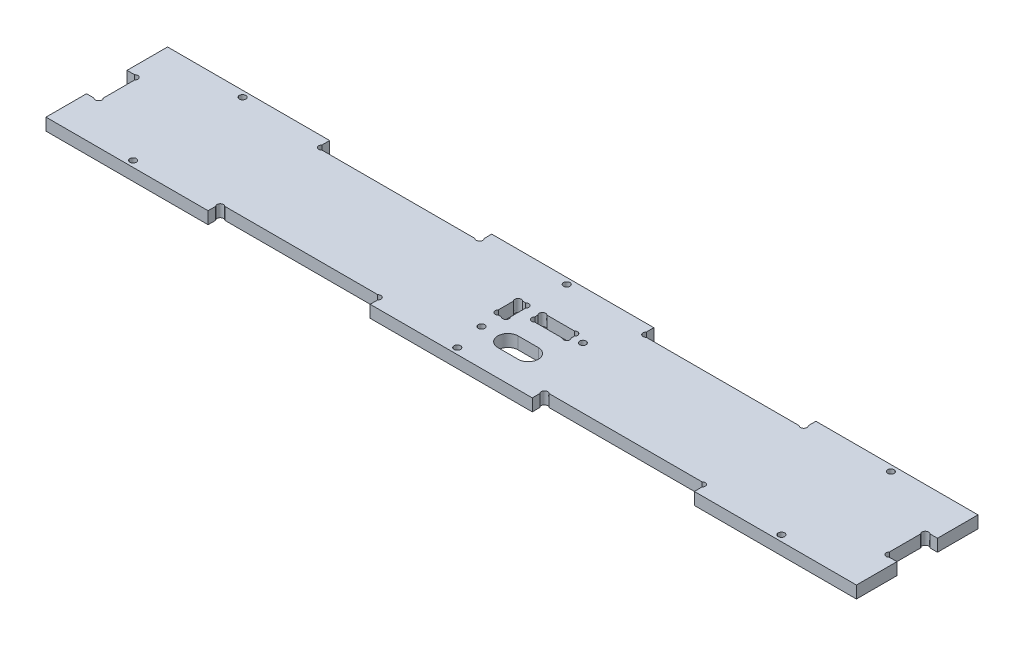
ISO-10303-21;
HEADER;
FILE_DESCRIPTION(('STEP AP214'),'2;1');
FILE_NAME('part.step','',(''),(''),'','','');
FILE_SCHEMA(('AUTOMOTIVE_DESIGN { 1 0 10303 214 1 1 1 1 }'));
ENDSEC;
DATA;
#1=APPLICATION_CONTEXT('core data for automotive mechanical design processes');
#2=APPLICATION_PROTOCOL_DEFINITION('international standard','automotive_design',2000,#1);
#3=PRODUCT_CONTEXT('',#1,'mechanical');
#4=PRODUCT('Part','Part','',(#3));
#5=PRODUCT_RELATED_PRODUCT_CATEGORY('part','',(#4));
#6=PRODUCT_DEFINITION_FORMATION('','',#4);
#7=PRODUCT_DEFINITION_CONTEXT('part definition',#1,'design');
#8=PRODUCT_DEFINITION('design','',#6,#7);
#9=PRODUCT_DEFINITION_SHAPE('','',#8);
#10=(LENGTH_UNIT() NAMED_UNIT(*) SI_UNIT(.MILLI.,.METRE.));
#11=(NAMED_UNIT(*) PLANE_ANGLE_UNIT() SI_UNIT($,.RADIAN.));
#12=(NAMED_UNIT(*) SI_UNIT($,.STERADIAN.) SOLID_ANGLE_UNIT());
#13=UNCERTAINTY_MEASURE_WITH_UNIT(LENGTH_MEASURE(1.E-05),#10,'distance_accuracy_value','');
#14=(GEOMETRIC_REPRESENTATION_CONTEXT(3) GLOBAL_UNCERTAINTY_ASSIGNED_CONTEXT((#13)) GLOBAL_UNIT_ASSIGNED_CONTEXT((#10,
#11,#12)) REPRESENTATION_CONTEXT('',''));
#15=CARTESIAN_POINT('',(0.,0.,0.));
#16=DIRECTION('',(0.,0.,1.));
#17=DIRECTION('',(1.,0.,0.));
#18=AXIS2_PLACEMENT_3D('',#15,#16,#17);
#19=CARTESIAN_POINT('',(195.131370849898,6.,8.86862915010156));
#20=DIRECTION('',(0.,-1.,0.));
#21=DIRECTION('',(0.,0.,-1.));
#22=AXIS2_PLACEMENT_3D('',#19,#20,#21);
#23=PLANE('',#22);
#24=CARTESIAN_POINT('',(-1.13137084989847,6.,-7.86862915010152));
#25=DIRECTION('',(0.,1.,0.));
#26=DIRECTION('',(0.,0.,1.));
#27=AXIS2_PLACEMENT_3D('',#24,#25,#26);
#28=CIRCLE('',#27,1.6);
#29=CARTESIAN_POINT('',(0.,6.,-6.73725830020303));
#30=VERTEX_POINT('',#29);
#31=CARTESIAN_POINT('',(-2.26274169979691,6.,-8.99999999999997));
#32=VERTEX_POINT('',#31);
#33=EDGE_CURVE('E414',#30,#32,#28,.T.);
#34=ORIENTED_EDGE('',*,*,#33,.F.);
#35=DIRECTION('',(0.,0.,-1.));
#36=VECTOR('',#35,1.);
#37=CARTESIAN_POINT('',(0.,6.,-6.73725830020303));
#38=LINE('',#37,#36);
#39=CARTESIAN_POINT('',(0.,6.,0.737258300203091));
#40=VERTEX_POINT('',#39);
#41=EDGE_CURVE('E449',#40,#30,#38,.T.);
#42=ORIENTED_EDGE('',*,*,#41,.F.);
#43=CARTESIAN_POINT('',(-1.13137084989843,6.,1.86862915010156));
#44=DIRECTION('',(0.,1.,0.));
#45=DIRECTION('',(0.,0.,-1.));
#46=AXIS2_PLACEMENT_3D('',#43,#44,#45);
#47=CIRCLE('',#46,1.6);
#48=CARTESIAN_POINT('',(-2.26274169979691,6.,3.00000000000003));
#49=VERTEX_POINT('',#48);
#50=EDGE_CURVE('E447',#49,#40,#47,.T.);
#51=ORIENTED_EDGE('',*,*,#50,.F.);
#52=DIRECTION('',(1.,0.,0.));
#53=VECTOR('',#52,1.);
#54=CARTESIAN_POINT('',(-3.73725830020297,6.,3.00000000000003));
#55=LINE('',#54,#53);
#56=CARTESIAN_POINT('',(-3.73725830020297,6.,3.00000000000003));
#57=VERTEX_POINT('',#56);
#58=EDGE_CURVE('E445',#57,#49,#55,.T.);
#59=ORIENTED_EDGE('',*,*,#58,.F.);
#60=CARTESIAN_POINT('',(-4.86862915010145,6.,1.86862915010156));
#61=DIRECTION('',(0.,1.,0.));
#62=DIRECTION('',(0.,0.,1.));
#63=AXIS2_PLACEMENT_3D('',#60,#61,#62);
#64=CIRCLE('',#63,1.6);
#65=CARTESIAN_POINT('',(-5.99999999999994,6.,0.737258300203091));
#66=VERTEX_POINT('',#65);
#67=EDGE_CURVE('E443',#66,#57,#64,.T.);
#68=ORIENTED_EDGE('',*,*,#67,.F.);
#69=DIRECTION('',(0.,0.,1.));
#70=VECTOR('',#69,1.);
#71=CARTESIAN_POINT('',(-5.99999999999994,6.,-6.73725830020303));
#72=LINE('',#71,#70);
#73=CARTESIAN_POINT('',(-5.99999999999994,6.,-6.73725830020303));
#74=VERTEX_POINT('',#73);
#75=EDGE_CURVE('E438',#74,#66,#72,.T.);
#76=ORIENTED_EDGE('',*,*,#75,.F.);
#77=CARTESIAN_POINT('',(-4.86862915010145,6.,-7.8686291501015));
#78=DIRECTION('',(0.,1.,0.));
#79=DIRECTION('',(0.,0.,-1.));
#80=AXIS2_PLACEMENT_3D('',#77,#78,#79);
#81=CIRCLE('',#80,1.6);
#82=CARTESIAN_POINT('',(-3.73725830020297,6.,-8.99999999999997));
#83=VERTEX_POINT('',#82);
#84=EDGE_CURVE('E436',#83,#74,#81,.T.);
#85=ORIENTED_EDGE('',*,*,#84,.F.);
#86=DIRECTION('',(-1.,0.,0.));
#87=VECTOR('',#86,1.);
#88=CARTESIAN_POINT('',(-3.73725830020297,6.,-8.99999999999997));
#89=LINE('',#88,#87);
#90=EDGE_CURVE('E422',#32,#83,#89,.T.);
#91=ORIENTED_EDGE('',*,*,#90,.F.);
#92=EDGE_LOOP('',(#34,#42,#51,#59,#68,#76,#85,#91));
#93=FACE_BOUND('',#92,.T.);
#94=CARTESIAN_POINT('',(10.0000000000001,6.,12.));
#95=DIRECTION('',(0.,1.,0.));
#96=DIRECTION('',(0.,0.,-1.));
#97=AXIS2_PLACEMENT_3D('',#94,#95,#96);
#98=CIRCLE('',#97,5.);
#99=CARTESIAN_POINT('',(10.0000000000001,6.,7.00000000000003));
#100=VERTEX_POINT('',#99);
#101=CARTESIAN_POINT('',(10.0000000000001,6.,17.));
#102=VERTEX_POINT('',#101);
#103=EDGE_CURVE('E488',#100,#102,#98,.T.);
#104=ORIENTED_EDGE('',*,*,#103,.F.);
#105=DIRECTION('',(-1.,0.,0.));
#106=VECTOR('',#105,1.);
#107=CARTESIAN_POINT('',(10.0000000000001,6.,7.00000000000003));
#108=LINE('',#107,#106);
#109=CARTESIAN_POINT('',(20.0000000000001,6.,7.00000000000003));
#110=VERTEX_POINT('',#109);
#111=EDGE_CURVE('E496',#110,#100,#108,.T.);
#112=ORIENTED_EDGE('',*,*,#111,.F.);
#113=CARTESIAN_POINT('',(20.0000000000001,6.,12.));
#114=DIRECTION('',(0.,1.,0.));
#115=DIRECTION('',(0.,0.,1.));
#116=AXIS2_PLACEMENT_3D('',#113,#114,#115);
#117=CIRCLE('',#116,5.);
#118=CARTESIAN_POINT('',(20.0000000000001,6.,17.));
#119=VERTEX_POINT('',#118);
#120=EDGE_CURVE('E493',#119,#110,#117,.T.);
#121=ORIENTED_EDGE('',*,*,#120,.F.);
#122=DIRECTION('',(1.,0.,0.));
#123=VECTOR('',#122,1.);
#124=CARTESIAN_POINT('',(20.0000000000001,6.,17.));
#125=LINE('',#124,#123);
#126=EDGE_CURVE('E490',#102,#119,#125,.T.);
#127=ORIENTED_EDGE('',*,*,#126,.F.);
#128=EDGE_LOOP('',(#104,#112,#121,#127));
#129=FACE_BOUND('',#128,.T.);
#130=CARTESIAN_POINT('',(-160.,6.,27.0000000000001));
#131=DIRECTION('',(0.,1.,0.));
#132=DIRECTION('',(0.,0.,-1.));
#133=AXIS2_PLACEMENT_3D('',#130,#131,#132);
#134=CIRCLE('',#133,1.59999999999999);
#135=CARTESIAN_POINT('',(-160.,6.,25.4000000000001));
#136=VERTEX_POINT('',#135);
#137=EDGE_CURVE('E578',#136,#136,#134,.T.);
#138=ORIENTED_EDGE('',*,*,#137,.F.);
#139=EDGE_LOOP('',(#138));
#140=FACE_BOUND('',#139,.T.);
#141=CARTESIAN_POINT('',(0.,6.,27.0000000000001));
#142=DIRECTION('',(0.,1.,0.));
#143=DIRECTION('',(0.,0.,-1.));
#144=AXIS2_PLACEMENT_3D('',#141,#142,#143);
#145=CIRCLE('',#144,1.6);
#146=CARTESIAN_POINT('',(0.,6.,25.4000000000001));
#147=VERTEX_POINT('',#146);
#148=EDGE_CURVE('E590',#147,#147,#145,.T.);
#149=ORIENTED_EDGE('',*,*,#148,.F.);
#150=EDGE_LOOP('',(#149));
#151=FACE_BOUND('',#150,.T.);
#152=CARTESIAN_POINT('',(160.,6.,-27.));
#153=DIRECTION('',(0.,1.,0.));
#154=DIRECTION('',(0.,0.,-1.));
#155=AXIS2_PLACEMENT_3D('',#152,#153,#154);
#156=CIRCLE('',#155,1.59999999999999);
#157=CARTESIAN_POINT('',(160.,6.,-28.6));
#158=VERTEX_POINT('',#157);
#159=EDGE_CURVE('E602',#158,#158,#156,.T.);
#160=ORIENTED_EDGE('',*,*,#159,.F.);
#161=EDGE_LOOP('',(#160));
#162=FACE_BOUND('',#161,.T.);
#163=DIRECTION('',(1.,0.,0.));
#164=VECTOR('',#163,1.);
#165=CARTESIAN_POINT('',(120.,6.,30.0000000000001));
#166=LINE('',#165,#164);
#167=CARTESIAN_POINT('',(120.,6.,30.0000000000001));
#168=VERTEX_POINT('',#167);
#169=CARTESIAN_POINT('',(200.,6.,30.));
#170=VERTEX_POINT('',#169);
#171=EDGE_CURVE('E614',#168,#170,#166,.T.);
#172=ORIENTED_EDGE('',*,*,#171,.T.);
#173=DIRECTION('',(0.,0.,-1.));
#174=VECTOR('',#173,1.);
#175=CARTESIAN_POINT('',(200.,6.,10.));
#176=LINE('',#175,#174);
#177=CARTESIAN_POINT('',(200.,6.,10.));
#178=VERTEX_POINT('',#177);
#179=EDGE_CURVE('E617',#170,#178,#176,.T.);
#180=ORIENTED_EDGE('',*,*,#179,.T.);
#181=DIRECTION('',(-1.,0.,0.));
#182=VECTOR('',#181,1.);
#183=CARTESIAN_POINT('',(196.262741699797,6.,10.));
#184=LINE('',#183,#182);
#185=CARTESIAN_POINT('',(196.262741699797,6.,10.));
#186=VERTEX_POINT('',#185);
#187=EDGE_CURVE('E620',#178,#186,#184,.T.);
#188=ORIENTED_EDGE('',*,*,#187,.T.);
#189=CARTESIAN_POINT('',(195.131370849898,6.,8.86862915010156));
#190=DIRECTION('',(0.,-1.,0.));
#191=DIRECTION('',(0.,0.,-1.));
#192=AXIS2_PLACEMENT_3D('',#189,#190,#191);
#193=CIRCLE('',#192,1.59999999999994);
#194=CARTESIAN_POINT('',(194.,6.,7.73725830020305));
#195=VERTEX_POINT('',#194);
#196=EDGE_CURVE('E622',#186,#195,#193,.T.);
#197=ORIENTED_EDGE('',*,*,#196,.T.);
#198=DIRECTION('',(0.,0.,-1.));
#199=VECTOR('',#198,1.);
#200=CARTESIAN_POINT('',(194.,6.,7.73725830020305));
#201=LINE('',#200,#199);
#202=CARTESIAN_POINT('',(194.,6.,-7.73725830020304));
#203=VERTEX_POINT('',#202);
#204=EDGE_CURVE('E624',#195,#203,#201,.T.);
#205=ORIENTED_EDGE('',*,*,#204,.T.);
#206=CARTESIAN_POINT('',(195.131370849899,6.,-8.86862915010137));
#207=DIRECTION('',(0.,-1.,0.));
#208=DIRECTION('',(0.,0.,1.));
#209=AXIS2_PLACEMENT_3D('',#206,#207,#208);
#210=CIRCLE('',#209,1.59999999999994);
#211=CARTESIAN_POINT('',(196.262741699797,6.,-10.));
#212=VERTEX_POINT('',#211);
#213=EDGE_CURVE('E626',#203,#212,#210,.T.);
#214=ORIENTED_EDGE('',*,*,#213,.T.);
#215=DIRECTION('',(1.,0.,0.));
#216=VECTOR('',#215,1.);
#217=CARTESIAN_POINT('',(196.262741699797,6.,-9.99999999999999));
#218=LINE('',#217,#216);
#219=CARTESIAN_POINT('',(200.,6.,-9.99999999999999));
#220=VERTEX_POINT('',#219);
#221=EDGE_CURVE('E628',#212,#220,#218,.T.);
#222=ORIENTED_EDGE('',*,*,#221,.T.);
#223=DIRECTION('',(0.,0.,-1.));
#224=VECTOR('',#223,1.);
#225=CARTESIAN_POINT('',(200.,6.,-30.));
#226=LINE('',#225,#224);
#227=CARTESIAN_POINT('',(200.,6.,-30.));
#228=VERTEX_POINT('',#227);
#229=EDGE_CURVE('E630',#220,#228,#226,.T.);
#230=ORIENTED_EDGE('',*,*,#229,.T.);
#231=DIRECTION('',(-1.,0.,0.));
#232=VECTOR('',#231,1.);
#233=CARTESIAN_POINT('',(120.,6.,-30.));
#234=LINE('',#233,#232);
#235=CARTESIAN_POINT('',(120.,6.,-30.));
#236=VERTEX_POINT('',#235);
#237=EDGE_CURVE('E632',#228,#236,#234,.T.);
#238=ORIENTED_EDGE('',*,*,#237,.T.);
#239=DIRECTION('',(0.,0.,1.));
#240=VECTOR('',#239,1.);
#241=CARTESIAN_POINT('',(120.,6.,-30.));
#242=LINE('',#241,#240);
#243=CARTESIAN_POINT('',(120.,6.,-26.2627416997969));
#244=VERTEX_POINT('',#243);
#245=EDGE_CURVE('E634',#236,#244,#242,.T.);
#246=ORIENTED_EDGE('',*,*,#245,.T.);
#247=CARTESIAN_POINT('',(118.868629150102,6.,-25.1313708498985));
#248=DIRECTION('',(0.,-1.,0.));
#249=DIRECTION('',(0.,0.,-1.));
#250=AXIS2_PLACEMENT_3D('',#247,#248,#249);
#251=CIRCLE('',#250,1.59999999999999);
#252=CARTESIAN_POINT('',(117.737258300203,6.,-24.));
#253=VERTEX_POINT('',#252);
#254=EDGE_CURVE('E636',#244,#253,#251,.T.);
#255=ORIENTED_EDGE('',*,*,#254,.T.);
#256=DIRECTION('',(-1.,0.,0.));
#257=VECTOR('',#256,1.);
#258=CARTESIAN_POINT('',(42.262741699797,6.,-24.));
#259=LINE('',#258,#257);
#260=CARTESIAN_POINT('',(42.262741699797,6.,-24.));
#261=VERTEX_POINT('',#260);
#262=EDGE_CURVE('E638',#253,#261,#259,.T.);
#263=ORIENTED_EDGE('',*,*,#262,.T.);
#264=CARTESIAN_POINT('',(41.1313708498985,6.,-25.1313708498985));
#265=DIRECTION('',(0.,-1.,0.));
#266=DIRECTION('',(0.,0.,1.));
#267=AXIS2_PLACEMENT_3D('',#264,#265,#266);
#268=CIRCLE('',#267,1.59999999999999);
#269=CARTESIAN_POINT('',(40.,6.,-26.2627416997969));
#270=VERTEX_POINT('',#269);
#271=EDGE_CURVE('E640',#261,#270,#268,.T.);
#272=ORIENTED_EDGE('',*,*,#271,.T.);
#273=DIRECTION('',(0.,0.,-1.));
#274=VECTOR('',#273,1.);
#275=CARTESIAN_POINT('',(40.0000000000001,6.,-30.));
#276=LINE('',#275,#274);
#277=CARTESIAN_POINT('',(40.0000000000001,6.,-30.));
#278=VERTEX_POINT('',#277);
#279=EDGE_CURVE('E642',#270,#278,#276,.T.);
#280=ORIENTED_EDGE('',*,*,#279,.T.);
#281=DIRECTION('',(-1.,0.,0.));
#282=VECTOR('',#281,1.);
#283=CARTESIAN_POINT('',(-40.0000000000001,6.,-30.));
#284=LINE('',#283,#282);
#285=CARTESIAN_POINT('',(-40.0000000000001,6.,-30.));
#286=VERTEX_POINT('',#285);
#287=EDGE_CURVE('E644',#278,#286,#284,.T.);
#288=ORIENTED_EDGE('',*,*,#287,.T.);
#289=DIRECTION('',(0.,0.,1.));
#290=VECTOR('',#289,1.);
#291=CARTESIAN_POINT('',(-40.0000000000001,6.,-30.));
#292=LINE('',#291,#290);
#293=CARTESIAN_POINT('',(-40.,6.,-26.2627416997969));
#294=VERTEX_POINT('',#293);
#295=EDGE_CURVE('E646',#286,#294,#292,.T.);
#296=ORIENTED_EDGE('',*,*,#295,.T.);
#297=CARTESIAN_POINT('',(-41.1313708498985,6.,-25.1313708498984));
#298=DIRECTION('',(0.,-1.,0.));
#299=DIRECTION('',(0.,0.,-1.));
#300=AXIS2_PLACEMENT_3D('',#297,#298,#299);
#301=CIRCLE('',#300,1.59999999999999);
#302=CARTESIAN_POINT('',(-42.262741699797,6.,-24.));
#303=VERTEX_POINT('',#302);
#304=EDGE_CURVE('E648',#294,#303,#301,.T.);
#305=ORIENTED_EDGE('',*,*,#304,.T.);
#306=DIRECTION('',(-1.,0.,0.));
#307=VECTOR('',#306,1.);
#308=CARTESIAN_POINT('',(-42.262741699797,6.,-24.));
#309=LINE('',#308,#307);
#310=CARTESIAN_POINT('',(-117.737258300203,6.,-23.9999999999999));
#311=VERTEX_POINT('',#310);
#312=EDGE_CURVE('E650',#303,#311,#309,.T.);
#313=ORIENTED_EDGE('',*,*,#312,.T.);
#314=CARTESIAN_POINT('',(-118.868629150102,6.,-25.1313708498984));
#315=DIRECTION('',(0.,-1.,0.));
#316=DIRECTION('',(0.,0.,1.));
#317=AXIS2_PLACEMENT_3D('',#314,#315,#316);
#318=CIRCLE('',#317,1.59999999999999);
#319=CARTESIAN_POINT('',(-120.,6.,-26.2627416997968));
#320=VERTEX_POINT('',#319);
#321=EDGE_CURVE('E652',#311,#320,#318,.T.);
#322=ORIENTED_EDGE('',*,*,#321,.T.);
#323=DIRECTION('',(0.,0.,-1.));
#324=VECTOR('',#323,1.);
#325=CARTESIAN_POINT('',(-120.,6.,-30.));
#326=LINE('',#325,#324);
#327=CARTESIAN_POINT('',(-120.,6.,-30.));
#328=VERTEX_POINT('',#327);
#329=EDGE_CURVE('E654',#320,#328,#326,.T.);
#330=ORIENTED_EDGE('',*,*,#329,.T.);
#331=DIRECTION('',(-1.,0.,0.));
#332=VECTOR('',#331,1.);
#333=CARTESIAN_POINT('',(-200.,6.,-30.));
#334=LINE('',#333,#332);
#335=CARTESIAN_POINT('',(-200.,6.,-30.));
#336=VERTEX_POINT('',#335);
#337=EDGE_CURVE('E656',#328,#336,#334,.T.);
#338=ORIENTED_EDGE('',*,*,#337,.T.);
#339=DIRECTION('',(0.,0.,1.));
#340=VECTOR('',#339,1.);
#341=CARTESIAN_POINT('',(-200.,6.,-30.));
#342=LINE('',#341,#340);
#343=CARTESIAN_POINT('',(-200.,6.,-9.9999999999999));
#344=VERTEX_POINT('',#343);
#345=EDGE_CURVE('E658',#336,#344,#342,.T.);
#346=ORIENTED_EDGE('',*,*,#345,.T.);
#347=DIRECTION('',(1.,0.,0.));
#348=VECTOR('',#347,1.);
#349=CARTESIAN_POINT('',(-196.262741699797,6.,-9.99999999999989));
#350=LINE('',#349,#348);
#351=CARTESIAN_POINT('',(-196.262741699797,6.,-9.99999999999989));
#352=VERTEX_POINT('',#351);
#353=EDGE_CURVE('E660',#344,#352,#350,.T.);
#354=ORIENTED_EDGE('',*,*,#353,.T.);
#355=CARTESIAN_POINT('',(-195.131370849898,6.,-8.86862915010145));
#356=DIRECTION('',(0.,-1.,0.));
#357=DIRECTION('',(0.,0.,-1.));
#358=AXIS2_PLACEMENT_3D('',#355,#356,#357);
#359=CIRCLE('',#358,1.59999999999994);
#360=CARTESIAN_POINT('',(-194.,6.,-7.73725830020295));
#361=VERTEX_POINT('',#360);
#362=EDGE_CURVE('E662',#352,#361,#359,.T.);
#363=ORIENTED_EDGE('',*,*,#362,.T.);
#364=DIRECTION('',(0.,0.,1.));
#365=VECTOR('',#364,1.);
#366=CARTESIAN_POINT('',(-194.,6.,7.73725830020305));
#367=LINE('',#366,#365);
#368=CARTESIAN_POINT('',(-194.,6.,7.73725830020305));
#369=VERTEX_POINT('',#368);
#370=EDGE_CURVE('E664',#361,#369,#367,.T.);
#371=ORIENTED_EDGE('',*,*,#370,.T.);
#372=CARTESIAN_POINT('',(-195.131370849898,6.,8.86862915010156));
#373=DIRECTION('',(0.,-1.,0.));
#374=DIRECTION('',(0.,0.,1.));
#375=AXIS2_PLACEMENT_3D('',#372,#373,#374);
#376=CIRCLE('',#375,1.59999999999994);
#377=CARTESIAN_POINT('',(-196.262741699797,6.,10.));
#378=VERTEX_POINT('',#377);
#379=EDGE_CURVE('E666',#369,#378,#376,.T.);
#380=ORIENTED_EDGE('',*,*,#379,.T.);
#381=DIRECTION('',(-1.,0.,0.));
#382=VECTOR('',#381,1.);
#383=CARTESIAN_POINT('',(-196.262741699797,6.,10.));
#384=LINE('',#383,#382);
#385=CARTESIAN_POINT('',(-200.,6.,10.));
#386=VERTEX_POINT('',#385);
#387=EDGE_CURVE('E668',#378,#386,#384,.T.);
#388=ORIENTED_EDGE('',*,*,#387,.T.);
#389=DIRECTION('',(0.,0.,1.));
#390=VECTOR('',#389,1.);
#391=CARTESIAN_POINT('',(-200.,6.,10.));
#392=LINE('',#391,#390);
#393=CARTESIAN_POINT('',(-200.,6.,30.0000000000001));
#394=VERTEX_POINT('',#393);
#395=EDGE_CURVE('E670',#386,#394,#392,.T.);
#396=ORIENTED_EDGE('',*,*,#395,.T.);
#397=DIRECTION('',(1.,0.,0.));
#398=VECTOR('',#397,1.);
#399=CARTESIAN_POINT('',(-200.,6.,30.0000000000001));
#400=LINE('',#399,#398);
#401=CARTESIAN_POINT('',(-120.,6.,30.0000000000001));
#402=VERTEX_POINT('',#401);
#403=EDGE_CURVE('E672',#394,#402,#400,.T.);
#404=ORIENTED_EDGE('',*,*,#403,.T.);
#405=DIRECTION('',(0.,0.,-1.));
#406=VECTOR('',#405,1.);
#407=CARTESIAN_POINT('',(-120.,6.,30.0000000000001));
#408=LINE('',#407,#406);
#409=CARTESIAN_POINT('',(-120.,6.,26.2627416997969));
#410=VERTEX_POINT('',#409);
#411=EDGE_CURVE('E674',#402,#410,#408,.T.);
#412=ORIENTED_EDGE('',*,*,#411,.T.);
#413=CARTESIAN_POINT('',(-118.868629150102,6.,25.1313708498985));
#414=DIRECTION('',(0.,-1.,0.));
#415=DIRECTION('',(0.,0.,-1.));
#416=AXIS2_PLACEMENT_3D('',#413,#414,#415);
#417=CIRCLE('',#416,1.59999999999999);
#418=CARTESIAN_POINT('',(-117.737258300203,6.,24.));
#419=VERTEX_POINT('',#418);
#420=EDGE_CURVE('E676',#410,#419,#417,.T.);
#421=ORIENTED_EDGE('',*,*,#420,.T.);
#422=DIRECTION('',(1.,0.,0.));
#423=VECTOR('',#422,1.);
#424=CARTESIAN_POINT('',(-42.262741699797,6.,24.));
#425=LINE('',#424,#423);
#426=CARTESIAN_POINT('',(-42.262741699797,6.,24.));
#427=VERTEX_POINT('',#426);
#428=EDGE_CURVE('E678',#419,#427,#425,.T.);
#429=ORIENTED_EDGE('',*,*,#428,.T.);
#430=CARTESIAN_POINT('',(-41.1313708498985,6.,25.1313708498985));
#431=DIRECTION('',(0.,-1.,0.));
#432=DIRECTION('',(0.,0.,1.));
#433=AXIS2_PLACEMENT_3D('',#430,#431,#432);
#434=CIRCLE('',#433,1.59999999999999);
#435=CARTESIAN_POINT('',(-40.,6.,26.2627416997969));
#436=VERTEX_POINT('',#435);
#437=EDGE_CURVE('E680',#427,#436,#434,.T.);
#438=ORIENTED_EDGE('',*,*,#437,.T.);
#439=DIRECTION('',(0.,0.,1.));
#440=VECTOR('',#439,1.);
#441=CARTESIAN_POINT('',(-40.0000000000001,6.,30.0000000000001));
#442=LINE('',#441,#440);
#443=CARTESIAN_POINT('',(-40.0000000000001,6.,30.0000000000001));
#444=VERTEX_POINT('',#443);
#445=EDGE_CURVE('E682',#436,#444,#442,.T.);
#446=ORIENTED_EDGE('',*,*,#445,.T.);
#447=DIRECTION('',(1.,0.,0.));
#448=VECTOR('',#447,1.);
#449=CARTESIAN_POINT('',(-40.0000000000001,6.,30.0000000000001));
#450=LINE('',#449,#448);
#451=CARTESIAN_POINT('',(40.0000000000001,6.,30.0000000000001));
#452=VERTEX_POINT('',#451);
#453=EDGE_CURVE('E684',#444,#452,#450,.T.);
#454=ORIENTED_EDGE('',*,*,#453,.T.);
#455=DIRECTION('',(0.,0.,-1.));
#456=VECTOR('',#455,1.);
#457=CARTESIAN_POINT('',(40.0000000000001,6.,30.0000000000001));
#458=LINE('',#457,#456);
#459=CARTESIAN_POINT('',(40.,6.,26.2627416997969));
#460=VERTEX_POINT('',#459);
#461=EDGE_CURVE('E686',#452,#460,#458,.T.);
#462=ORIENTED_EDGE('',*,*,#461,.T.);
#463=CARTESIAN_POINT('',(41.1313708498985,6.,25.1313708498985));
#464=DIRECTION('',(0.,-1.,0.));
#465=DIRECTION('',(0.,0.,-1.));
#466=AXIS2_PLACEMENT_3D('',#463,#464,#465);
#467=CIRCLE('',#466,1.59999999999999);
#468=CARTESIAN_POINT('',(42.262741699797,6.,24.));
#469=VERTEX_POINT('',#468);
#470=EDGE_CURVE('E688',#460,#469,#467,.T.);
#471=ORIENTED_EDGE('',*,*,#470,.T.);
#472=DIRECTION('',(1.,0.,0.));
#473=VECTOR('',#472,1.);
#474=CARTESIAN_POINT('',(42.262741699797,6.,24.));
#475=LINE('',#474,#473);
#476=CARTESIAN_POINT('',(117.737258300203,6.,24.));
#477=VERTEX_POINT('',#476);
#478=EDGE_CURVE('E690',#469,#477,#475,.T.);
#479=ORIENTED_EDGE('',*,*,#478,.T.);
#480=CARTESIAN_POINT('',(118.868629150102,6.,25.1313708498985));
#481=DIRECTION('',(0.,-1.,0.));
#482=DIRECTION('',(0.,0.,1.));
#483=AXIS2_PLACEMENT_3D('',#480,#481,#482);
#484=CIRCLE('',#483,1.59999999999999);
#485=CARTESIAN_POINT('',(120.,6.,26.2627416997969));
#486=VERTEX_POINT('',#485);
#487=EDGE_CURVE('E692',#477,#486,#484,.T.);
#488=ORIENTED_EDGE('',*,*,#487,.T.);
#489=DIRECTION('',(0.,0.,1.));
#490=VECTOR('',#489,1.);
#491=CARTESIAN_POINT('',(120.,6.,30.0000000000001));
#492=LINE('',#491,#490);
#493=EDGE_CURVE('E694',#486,#168,#492,.T.);
#494=ORIENTED_EDGE('',*,*,#493,.T.);
#495=EDGE_LOOP('',(#172,#180,#188,#197,#205,#214,#222,#230,#238,#246,#255,#263,#272,#280,#288,
#296,#305,#313,#322,#330,#338,#346,#354,#363,#371,#380,#388,#396,#404,#412,#421,#429,#438,#446,
#454,#462,#471,#479,#488,#494));
#496=FACE_BOUND('',#495,.T.);
#497=CARTESIAN_POINT('',(0.,6.,-27.));
#498=DIRECTION('',(0.,1.,0.));
#499=DIRECTION('',(0.,0.,1.));
#500=AXIS2_PLACEMENT_3D('',#497,#498,#499);
#501=CIRCLE('',#500,1.6);
#502=CARTESIAN_POINT('',(0.,6.,-25.4));
#503=VERTEX_POINT('',#502);
#504=EDGE_CURVE('E608',#503,#503,#501,.T.);
#505=ORIENTED_EDGE('',*,*,#504,.F.);
#506=EDGE_LOOP('',(#505));
#507=FACE_BOUND('',#506,.T.);
#508=CARTESIAN_POINT('',(-160.,6.,-27.));
#509=DIRECTION('',(0.,1.,0.));
#510=DIRECTION('',(0.,0.,1.));
#511=AXIS2_PLACEMENT_3D('',#508,#509,#510);
#512=CIRCLE('',#511,1.59999999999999);
#513=CARTESIAN_POINT('',(-160.,6.,-25.4));
#514=VERTEX_POINT('',#513);
#515=EDGE_CURVE('E596',#514,#514,#512,.T.);
#516=ORIENTED_EDGE('',*,*,#515,.F.);
#517=EDGE_LOOP('',(#516));
#518=FACE_BOUND('',#517,.T.);
#519=CARTESIAN_POINT('',(160.,6.,27.0000000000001));
#520=DIRECTION('',(0.,1.,0.));
#521=DIRECTION('',(0.,0.,1.));
#522=AXIS2_PLACEMENT_3D('',#519,#520,#521);
#523=CIRCLE('',#522,1.59999999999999);
#524=CARTESIAN_POINT('',(160.,6.,28.6000000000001));
#525=VERTEX_POINT('',#524);
#526=EDGE_CURVE('E584',#525,#525,#523,.T.);
#527=ORIENTED_EDGE('',*,*,#526,.F.);
#528=EDGE_LOOP('',(#527));
#529=FACE_BOUND('',#528,.T.);
#530=CARTESIAN_POINT('',(22.8686291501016,6.,-7.86862915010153));
#531=DIRECTION('',(0.,1.,0.));
#532=DIRECTION('',(0.,0.,1.));
#533=AXIS2_PLACEMENT_3D('',#530,#531,#532);
#534=CIRCLE('',#533,1.6);
#535=CARTESIAN_POINT('',(24.0000000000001,6.,-6.73725830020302));
#536=VERTEX_POINT('',#535);
#537=CARTESIAN_POINT('',(21.7372583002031,6.,-8.99999999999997));
#538=VERTEX_POINT('',#537);
#539=EDGE_CURVE('E519',#536,#538,#534,.T.);
#540=ORIENTED_EDGE('',*,*,#539,.F.);
#541=DIRECTION('',(0.,0.,-1.));
#542=VECTOR('',#541,1.);
#543=CARTESIAN_POINT('',(24.0000000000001,6.,-6.73725830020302));
#544=LINE('',#543,#542);
#545=CARTESIAN_POINT('',(24.,6.,-5.26274169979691));
#546=VERTEX_POINT('',#545);
#547=EDGE_CURVE('E535',#546,#536,#544,.T.);
#548=ORIENTED_EDGE('',*,*,#547,.F.);
#549=CARTESIAN_POINT('',(22.8686291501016,6.,-4.13137084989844));
#550=DIRECTION('',(0.,1.,0.));
#551=DIRECTION('',(0.,0.,-1.));
#552=AXIS2_PLACEMENT_3D('',#549,#550,#551);
#553=CIRCLE('',#552,1.6);
#554=CARTESIAN_POINT('',(21.7372583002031,6.,-2.99999999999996));
#555=VERTEX_POINT('',#554);
#556=EDGE_CURVE('E532',#555,#546,#553,.T.);
#557=ORIENTED_EDGE('',*,*,#556,.F.);
#558=DIRECTION('',(1.,0.,0.));
#559=VECTOR('',#558,1.);
#560=CARTESIAN_POINT('',(8.26274169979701,6.,-2.99999999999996));
#561=LINE('',#560,#559);
#562=CARTESIAN_POINT('',(8.26274169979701,6.,-2.99999999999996));
#563=VERTEX_POINT('',#562);
#564=EDGE_CURVE('E530',#563,#555,#561,.T.);
#565=ORIENTED_EDGE('',*,*,#564,.F.);
#566=CARTESIAN_POINT('',(7.13137084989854,6.,-4.13137084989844));
#567=DIRECTION('',(0.,1.,0.));
#568=DIRECTION('',(0.,0.,1.));
#569=AXIS2_PLACEMENT_3D('',#566,#567,#568);
#570=CIRCLE('',#569,1.6);
#571=CARTESIAN_POINT('',(6.00000000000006,6.,-5.26274169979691));
#572=VERTEX_POINT('',#571);
#573=EDGE_CURVE('E528',#572,#563,#570,.T.);
#574=ORIENTED_EDGE('',*,*,#573,.F.);
#575=DIRECTION('',(0.,0.,1.));
#576=VECTOR('',#575,1.);
#577=CARTESIAN_POINT('',(6.00000000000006,6.,-6.73725830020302));
#578=LINE('',#577,#576);
#579=CARTESIAN_POINT('',(6.00000000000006,6.,-6.73725830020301));
#580=VERTEX_POINT('',#579);
#581=EDGE_CURVE('E526',#580,#572,#578,.T.);
#582=ORIENTED_EDGE('',*,*,#581,.F.);
#583=CARTESIAN_POINT('',(7.13137084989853,6.,-7.86862915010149));
#584=DIRECTION('',(0.,1.,0.));
#585=DIRECTION('',(0.,0.,-1.));
#586=AXIS2_PLACEMENT_3D('',#583,#584,#585);
#587=CIRCLE('',#586,1.6);
#588=CARTESIAN_POINT('',(8.26274169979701,6.,-8.99999999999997));
#589=VERTEX_POINT('',#588);
#590=EDGE_CURVE('E524',#589,#580,#587,.T.);
#591=ORIENTED_EDGE('',*,*,#590,.F.);
#592=DIRECTION('',(-1.,0.,0.));
#593=VECTOR('',#592,1.);
#594=CARTESIAN_POINT('',(8.26274169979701,6.,-8.99999999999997));
#595=LINE('',#594,#593);
#596=EDGE_CURVE('E521',#538,#589,#595,.T.);
#597=ORIENTED_EDGE('',*,*,#596,.F.);
#598=EDGE_LOOP('',(#540,#548,#557,#565,#574,#582,#591,#597));
#599=FACE_BOUND('',#598,.T.);
#600=CARTESIAN_POINT('',(29.,6.,-5.99999999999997));
#601=DIRECTION('',(0.,1.,0.));
#602=DIRECTION('',(0.,0.,-1.));
#603=AXIS2_PLACEMENT_3D('',#600,#601,#602);
#604=CIRCLE('',#603,1.6);
#605=CARTESIAN_POINT('',(29.,6.,-7.59999999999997));
#606=VERTEX_POINT('',#605);
#607=EDGE_CURVE('E482',#606,#606,#604,.T.);
#608=ORIENTED_EDGE('',*,*,#607,.F.);
#609=EDGE_LOOP('',(#608));
#610=FACE_BOUND('',#609,.T.);
#611=CARTESIAN_POINT('',(-2.99999999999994,6.,12.));
#612=DIRECTION('',(0.,1.,0.));
#613=DIRECTION('',(0.,0.,1.));
#614=AXIS2_PLACEMENT_3D('',#611,#612,#613);
#615=CIRCLE('',#614,1.6);
#616=CARTESIAN_POINT('',(-2.99999999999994,6.,13.6));
#617=VERTEX_POINT('',#616);
#618=EDGE_CURVE('E452',#617,#617,#615,.T.);
#619=ORIENTED_EDGE('',*,*,#618,.F.);
#620=EDGE_LOOP('',(#619));
#621=FACE_BOUND('',#620,.T.);
#622=ADVANCED_FACE('F37',(#93,#129,#140,#151,#162,#496,#507,#518,#529,#599,#610,#621),#23,.F.);
#623=CARTESIAN_POINT('',(195.131370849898,0.,8.86862915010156));
#624=DIRECTION('',(0.,-1.,0.));
#625=DIRECTION('',(0.,0.,-1.));
#626=AXIS2_PLACEMENT_3D('',#623,#624,#625);
#627=PLANE('',#626);
#628=DIRECTION('',(0.,0.,-1.));
#629=VECTOR('',#628,1.);
#630=CARTESIAN_POINT('',(0.,0.,-6.73725830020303));
#631=LINE('',#630,#629);
#632=CARTESIAN_POINT('',(0.,0.,0.737258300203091));
#633=VERTEX_POINT('',#632);
#634=CARTESIAN_POINT('',(0.,0.,-6.73725830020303));
#635=VERTEX_POINT('',#634);
#636=EDGE_CURVE('E423',#633,#635,#631,.T.);
#637=ORIENTED_EDGE('',*,*,#636,.T.);
#638=CARTESIAN_POINT('',(-1.13137084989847,0.,-7.86862915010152));
#639=DIRECTION('',(0.,1.,0.));
#640=DIRECTION('',(0.,0.,1.));
#641=AXIS2_PLACEMENT_3D('',#638,#639,#640);
#642=CIRCLE('',#641,1.6);
#643=CARTESIAN_POINT('',(-2.26274169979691,0.,-8.99999999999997));
#644=VERTEX_POINT('',#643);
#645=EDGE_CURVE('E60',#635,#644,#642,.T.);
#646=ORIENTED_EDGE('',*,*,#645,.T.);
#647=DIRECTION('',(-1.,0.,0.));
#648=VECTOR('',#647,1.);
#649=CARTESIAN_POINT('',(-3.73725830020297,0.,-8.99999999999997));
#650=LINE('',#649,#648);
#651=CARTESIAN_POINT('',(-3.73725830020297,0.,-8.99999999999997));
#652=VERTEX_POINT('',#651);
#653=EDGE_CURVE('E429',#644,#652,#650,.T.);
#654=ORIENTED_EDGE('',*,*,#653,.T.);
#655=CARTESIAN_POINT('',(-4.86862915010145,0.,-7.8686291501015));
#656=DIRECTION('',(0.,1.,0.));
#657=DIRECTION('',(0.,0.,-1.));
#658=AXIS2_PLACEMENT_3D('',#655,#656,#657);
#659=CIRCLE('',#658,1.6);
#660=CARTESIAN_POINT('',(-5.99999999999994,0.,-6.73725830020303));
#661=VERTEX_POINT('',#660);
#662=EDGE_CURVE('E454',#652,#661,#659,.T.);
#663=ORIENTED_EDGE('',*,*,#662,.T.);
#664=DIRECTION('',(0.,0.,1.));
#665=VECTOR('',#664,1.);
#666=CARTESIAN_POINT('',(-5.99999999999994,0.,-6.73725830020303));
#667=LINE('',#666,#665);
#668=CARTESIAN_POINT('',(-5.99999999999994,0.,0.737258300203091));
#669=VERTEX_POINT('',#668);
#670=EDGE_CURVE('E457',#661,#669,#667,.T.);
#671=ORIENTED_EDGE('',*,*,#670,.T.);
#672=CARTESIAN_POINT('',(-4.86862915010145,0.,1.86862915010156));
#673=DIRECTION('',(0.,1.,0.));
#674=DIRECTION('',(0.,0.,1.));
#675=AXIS2_PLACEMENT_3D('',#672,#673,#674);
#676=CIRCLE('',#675,1.6);
#677=CARTESIAN_POINT('',(-3.73725830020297,0.,3.00000000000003));
#678=VERTEX_POINT('',#677);
#679=EDGE_CURVE('E460',#669,#678,#676,.T.);
#680=ORIENTED_EDGE('',*,*,#679,.T.);
#681=DIRECTION('',(1.,0.,0.));
#682=VECTOR('',#681,1.);
#683=CARTESIAN_POINT('',(-3.73725830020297,0.,3.00000000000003));
#684=LINE('',#683,#682);
#685=CARTESIAN_POINT('',(-2.26274169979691,0.,3.00000000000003));
#686=VERTEX_POINT('',#685);
#687=EDGE_CURVE('E463',#678,#686,#684,.T.);
#688=ORIENTED_EDGE('',*,*,#687,.T.);
#689=CARTESIAN_POINT('',(-1.13137084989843,0.,1.86862915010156));
#690=DIRECTION('',(0.,1.,0.));
#691=DIRECTION('',(0.,0.,-1.));
#692=AXIS2_PLACEMENT_3D('',#689,#690,#691);
#693=CIRCLE('',#692,1.6);
#694=EDGE_CURVE('E466',#686,#633,#693,.T.);
#695=ORIENTED_EDGE('',*,*,#694,.T.);
#696=EDGE_LOOP('',(#637,#646,#654,#663,#671,#680,#688,#695));
#697=FACE_BOUND('',#696,.T.);
#698=DIRECTION('',(-1.,0.,0.));
#699=VECTOR('',#698,1.);
#700=CARTESIAN_POINT('',(10.0000000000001,0.,7.00000000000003));
#701=LINE('',#700,#699);
#702=CARTESIAN_POINT('',(20.0000000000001,0.,7.00000000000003));
#703=VERTEX_POINT('',#702);
#704=CARTESIAN_POINT('',(10.0000000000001,0.,7.00000000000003));
#705=VERTEX_POINT('',#704);
#706=EDGE_CURVE('E491',#703,#705,#701,.T.);
#707=ORIENTED_EDGE('',*,*,#706,.T.);
#708=CARTESIAN_POINT('',(10.0000000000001,0.,12.));
#709=DIRECTION('',(0.,1.,0.));
#710=DIRECTION('',(0.,0.,-1.));
#711=AXIS2_PLACEMENT_3D('',#708,#709,#710);
#712=CIRCLE('',#711,5.);
#713=CARTESIAN_POINT('',(10.0000000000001,0.,17.));
#714=VERTEX_POINT('',#713);
#715=EDGE_CURVE('E485',#705,#714,#712,.T.);
#716=ORIENTED_EDGE('',*,*,#715,.T.);
#717=DIRECTION('',(1.,0.,0.));
#718=VECTOR('',#717,1.);
#719=CARTESIAN_POINT('',(20.0000000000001,0.,17.));
#720=LINE('',#719,#718);
#721=CARTESIAN_POINT('',(20.0000000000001,0.,17.));
#722=VERTEX_POINT('',#721);
#723=EDGE_CURVE('E501',#714,#722,#720,.T.);
#724=ORIENTED_EDGE('',*,*,#723,.T.);
#725=CARTESIAN_POINT('',(20.0000000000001,0.,12.));
#726=DIRECTION('',(0.,1.,0.));
#727=DIRECTION('',(0.,0.,1.));
#728=AXIS2_PLACEMENT_3D('',#725,#726,#727);
#729=CIRCLE('',#728,5.);
#730=EDGE_CURVE('E504',#722,#703,#729,.T.);
#731=ORIENTED_EDGE('',*,*,#730,.T.);
#732=EDGE_LOOP('',(#707,#716,#724,#731));
#733=FACE_BOUND('',#732,.T.);
#734=CARTESIAN_POINT('',(-160.,0.,27.0000000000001));
#735=DIRECTION('',(0.,1.,0.));
#736=DIRECTION('',(0.,0.,-1.));
#737=AXIS2_PLACEMENT_3D('',#734,#735,#736);
#738=CIRCLE('',#737,1.59999999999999);
#739=CARTESIAN_POINT('',(-160.,0.,25.4000000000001));
#740=VERTEX_POINT('',#739);
#741=EDGE_CURVE('E577',#740,#740,#738,.T.);
#742=ORIENTED_EDGE('',*,*,#741,.T.);
#743=EDGE_LOOP('',(#742));
#744=FACE_BOUND('',#743,.T.);
#745=CARTESIAN_POINT('',(0.,0.,27.0000000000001));
#746=DIRECTION('',(0.,1.,0.));
#747=DIRECTION('',(0.,0.,-1.));
#748=AXIS2_PLACEMENT_3D('',#745,#746,#747);
#749=CIRCLE('',#748,1.6);
#750=CARTESIAN_POINT('',(0.,0.,25.4000000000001));
#751=VERTEX_POINT('',#750);
#752=EDGE_CURVE('E587',#751,#751,#749,.T.);
#753=ORIENTED_EDGE('',*,*,#752,.T.);
#754=EDGE_LOOP('',(#753));
#755=FACE_BOUND('',#754,.T.);
#756=CARTESIAN_POINT('',(160.,0.,-27.));
#757=DIRECTION('',(0.,1.,0.));
#758=DIRECTION('',(0.,0.,-1.));
#759=AXIS2_PLACEMENT_3D('',#756,#757,#758);
#760=CIRCLE('',#759,1.59999999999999);
#761=CARTESIAN_POINT('',(160.,0.,-28.6));
#762=VERTEX_POINT('',#761);
#763=EDGE_CURVE('E599',#762,#762,#760,.T.);
#764=ORIENTED_EDGE('',*,*,#763,.T.);
#765=EDGE_LOOP('',(#764));
#766=FACE_BOUND('',#765,.T.);
#767=DIRECTION('',(1.,0.,0.));
#768=VECTOR('',#767,1.);
#769=CARTESIAN_POINT('',(120.,0.,30.0000000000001));
#770=LINE('',#769,#768);
#771=CARTESIAN_POINT('',(120.,0.,30.0000000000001));
#772=VERTEX_POINT('',#771);
#773=CARTESIAN_POINT('',(200.,0.,30.));
#774=VERTEX_POINT('',#773);
#775=EDGE_CURVE('E611',#772,#774,#770,.T.);
#776=ORIENTED_EDGE('',*,*,#775,.F.);
#777=DIRECTION('',(0.,0.,1.));
#778=VECTOR('',#777,1.);
#779=CARTESIAN_POINT('',(120.,0.,30.0000000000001));
#780=LINE('',#779,#778);
#781=CARTESIAN_POINT('',(120.,0.,26.2627416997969));
#782=VERTEX_POINT('',#781);
#783=EDGE_CURVE('E618',#782,#772,#780,.T.);
#784=ORIENTED_EDGE('',*,*,#783,.F.);
#785=CARTESIAN_POINT('',(118.868629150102,0.,25.1313708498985));
#786=DIRECTION('',(0.,-1.,0.));
#787=DIRECTION('',(0.,0.,1.));
#788=AXIS2_PLACEMENT_3D('',#785,#786,#787);
#789=CIRCLE('',#788,1.59999999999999);
#790=CARTESIAN_POINT('',(117.737258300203,0.,24.));
#791=VERTEX_POINT('',#790);
#792=EDGE_CURVE('E773',#791,#782,#789,.T.);
#793=ORIENTED_EDGE('',*,*,#792,.F.);
#794=DIRECTION('',(1.,0.,0.));
#795=VECTOR('',#794,1.);
#796=CARTESIAN_POINT('',(42.262741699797,0.,24.));
#797=LINE('',#796,#795);
#798=CARTESIAN_POINT('',(42.262741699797,0.,24.));
#799=VERTEX_POINT('',#798);
#800=EDGE_CURVE('E771',#799,#791,#797,.T.);
#801=ORIENTED_EDGE('',*,*,#800,.F.);
#802=CARTESIAN_POINT('',(41.1313708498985,0.,25.1313708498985));
#803=DIRECTION('',(0.,-1.,0.));
#804=DIRECTION('',(0.,0.,-1.));
#805=AXIS2_PLACEMENT_3D('',#802,#803,#804);
#806=CIRCLE('',#805,1.59999999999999);
#807=CARTESIAN_POINT('',(40.,0.,26.2627416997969));
#808=VERTEX_POINT('',#807);
#809=EDGE_CURVE('E769',#808,#799,#806,.T.);
#810=ORIENTED_EDGE('',*,*,#809,.F.);
#811=DIRECTION('',(0.,0.,-1.));
#812=VECTOR('',#811,1.);
#813=CARTESIAN_POINT('',(40.0000000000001,0.,30.0000000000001));
#814=LINE('',#813,#812);
#815=CARTESIAN_POINT('',(40.0000000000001,0.,30.0000000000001));
#816=VERTEX_POINT('',#815);
#817=EDGE_CURVE('E767',#816,#808,#814,.T.);
#818=ORIENTED_EDGE('',*,*,#817,.F.);
#819=DIRECTION('',(1.,0.,0.));
#820=VECTOR('',#819,1.);
#821=CARTESIAN_POINT('',(-40.0000000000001,0.,30.0000000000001));
#822=LINE('',#821,#820);
#823=CARTESIAN_POINT('',(-40.0000000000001,0.,30.0000000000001));
#824=VERTEX_POINT('',#823);
#825=EDGE_CURVE('E765',#824,#816,#822,.T.);
#826=ORIENTED_EDGE('',*,*,#825,.F.);
#827=DIRECTION('',(0.,0.,1.));
#828=VECTOR('',#827,1.);
#829=CARTESIAN_POINT('',(-40.0000000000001,0.,30.0000000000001));
#830=LINE('',#829,#828);
#831=CARTESIAN_POINT('',(-40.,0.,26.2627416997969));
#832=VERTEX_POINT('',#831);
#833=EDGE_CURVE('E763',#832,#824,#830,.T.);
#834=ORIENTED_EDGE('',*,*,#833,.F.);
#835=CARTESIAN_POINT('',(-41.1313708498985,0.,25.1313708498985));
#836=DIRECTION('',(0.,-1.,0.));
#837=DIRECTION('',(0.,0.,1.));
#838=AXIS2_PLACEMENT_3D('',#835,#836,#837);
#839=CIRCLE('',#838,1.59999999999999);
#840=CARTESIAN_POINT('',(-42.262741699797,0.,24.));
#841=VERTEX_POINT('',#840);
#842=EDGE_CURVE('E761',#841,#832,#839,.T.);
#843=ORIENTED_EDGE('',*,*,#842,.F.);
#844=DIRECTION('',(1.,0.,0.));
#845=VECTOR('',#844,1.);
#846=CARTESIAN_POINT('',(-42.262741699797,0.,24.));
#847=LINE('',#846,#845);
#848=CARTESIAN_POINT('',(-117.737258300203,0.,24.));
#849=VERTEX_POINT('',#848);
#850=EDGE_CURVE('E759',#849,#841,#847,.T.);
#851=ORIENTED_EDGE('',*,*,#850,.F.);
#852=CARTESIAN_POINT('',(-118.868629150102,0.,25.1313708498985));
#853=DIRECTION('',(0.,-1.,0.));
#854=DIRECTION('',(0.,0.,-1.));
#855=AXIS2_PLACEMENT_3D('',#852,#853,#854);
#856=CIRCLE('',#855,1.59999999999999);
#857=CARTESIAN_POINT('',(-120.,0.,26.2627416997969));
#858=VERTEX_POINT('',#857);
#859=EDGE_CURVE('E757',#858,#849,#856,.T.);
#860=ORIENTED_EDGE('',*,*,#859,.F.);
#861=DIRECTION('',(0.,0.,-1.));
#862=VECTOR('',#861,1.);
#863=CARTESIAN_POINT('',(-120.,0.,30.0000000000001));
#864=LINE('',#863,#862);
#865=CARTESIAN_POINT('',(-120.,0.,30.0000000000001));
#866=VERTEX_POINT('',#865);
#867=EDGE_CURVE('E755',#866,#858,#864,.T.);
#868=ORIENTED_EDGE('',*,*,#867,.F.);
#869=DIRECTION('',(1.,0.,0.));
#870=VECTOR('',#869,1.);
#871=CARTESIAN_POINT('',(-200.,0.,30.0000000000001));
#872=LINE('',#871,#870);
#873=CARTESIAN_POINT('',(-200.,0.,30.0000000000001));
#874=VERTEX_POINT('',#873);
#875=EDGE_CURVE('E753',#874,#866,#872,.T.);
#876=ORIENTED_EDGE('',*,*,#875,.F.);
#877=DIRECTION('',(0.,0.,1.));
#878=VECTOR('',#877,1.);
#879=CARTESIAN_POINT('',(-200.,0.,10.));
#880=LINE('',#879,#878);
#881=CARTESIAN_POINT('',(-200.,0.,10.));
#882=VERTEX_POINT('',#881);
#883=EDGE_CURVE('E751',#882,#874,#880,.T.);
#884=ORIENTED_EDGE('',*,*,#883,.F.);
#885=DIRECTION('',(-1.,0.,0.));
#886=VECTOR('',#885,1.);
#887=CARTESIAN_POINT('',(-196.262741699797,0.,10.));
#888=LINE('',#887,#886);
#889=CARTESIAN_POINT('',(-196.262741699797,0.,10.));
#890=VERTEX_POINT('',#889);
#891=EDGE_CURVE('E749',#890,#882,#888,.T.);
#892=ORIENTED_EDGE('',*,*,#891,.F.);
#893=CARTESIAN_POINT('',(-195.131370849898,0.,8.86862915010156));
#894=DIRECTION('',(0.,-1.,0.));
#895=DIRECTION('',(0.,0.,1.));
#896=AXIS2_PLACEMENT_3D('',#893,#894,#895);
#897=CIRCLE('',#896,1.59999999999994);
#898=CARTESIAN_POINT('',(-194.,0.,7.73725830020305));
#899=VERTEX_POINT('',#898);
#900=EDGE_CURVE('E747',#899,#890,#897,.T.);
#901=ORIENTED_EDGE('',*,*,#900,.F.);
#902=DIRECTION('',(0.,0.,1.));
#903=VECTOR('',#902,1.);
#904=CARTESIAN_POINT('',(-194.,0.,7.73725830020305));
#905=LINE('',#904,#903);
#906=CARTESIAN_POINT('',(-194.,0.,-7.73725830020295));
#907=VERTEX_POINT('',#906);
#908=EDGE_CURVE('E745',#907,#899,#905,.T.);
#909=ORIENTED_EDGE('',*,*,#908,.F.);
#910=CARTESIAN_POINT('',(-195.131370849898,0.,-8.86862915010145));
#911=DIRECTION('',(0.,-1.,0.));
#912=DIRECTION('',(0.,0.,-1.));
#913=AXIS2_PLACEMENT_3D('',#910,#911,#912);
#914=CIRCLE('',#913,1.59999999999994);
#915=CARTESIAN_POINT('',(-196.262741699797,0.,-9.99999999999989));
#916=VERTEX_POINT('',#915);
#917=EDGE_CURVE('E743',#916,#907,#914,.T.);
#918=ORIENTED_EDGE('',*,*,#917,.F.);
#919=DIRECTION('',(1.,0.,0.));
#920=VECTOR('',#919,1.);
#921=CARTESIAN_POINT('',(-196.262741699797,0.,-9.99999999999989));
#922=LINE('',#921,#920);
#923=CARTESIAN_POINT('',(-200.,0.,-9.9999999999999));
#924=VERTEX_POINT('',#923);
#925=EDGE_CURVE('E741',#924,#916,#922,.T.);
#926=ORIENTED_EDGE('',*,*,#925,.F.);
#927=DIRECTION('',(0.,0.,1.));
#928=VECTOR('',#927,1.);
#929=CARTESIAN_POINT('',(-200.,0.,-30.));
#930=LINE('',#929,#928);
#931=CARTESIAN_POINT('',(-200.,0.,-30.));
#932=VERTEX_POINT('',#931);
#933=EDGE_CURVE('E739',#932,#924,#930,.T.);
#934=ORIENTED_EDGE('',*,*,#933,.F.);
#935=DIRECTION('',(-1.,0.,0.));
#936=VECTOR('',#935,1.);
#937=CARTESIAN_POINT('',(-200.,0.,-30.));
#938=LINE('',#937,#936);
#939=CARTESIAN_POINT('',(-120.,0.,-30.));
#940=VERTEX_POINT('',#939);
#941=EDGE_CURVE('E737',#940,#932,#938,.T.);
#942=ORIENTED_EDGE('',*,*,#941,.F.);
#943=DIRECTION('',(0.,0.,-1.));
#944=VECTOR('',#943,1.);
#945=CARTESIAN_POINT('',(-120.,0.,-30.));
#946=LINE('',#945,#944);
#947=CARTESIAN_POINT('',(-120.,0.,-26.2627416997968));
#948=VERTEX_POINT('',#947);
#949=EDGE_CURVE('E735',#948,#940,#946,.T.);
#950=ORIENTED_EDGE('',*,*,#949,.F.);
#951=CARTESIAN_POINT('',(-118.868629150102,0.,-25.1313708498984));
#952=DIRECTION('',(0.,-1.,0.));
#953=DIRECTION('',(0.,0.,1.));
#954=AXIS2_PLACEMENT_3D('',#951,#952,#953);
#955=CIRCLE('',#954,1.59999999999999);
#956=CARTESIAN_POINT('',(-117.737258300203,0.,-23.9999999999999));
#957=VERTEX_POINT('',#956);
#958=EDGE_CURVE('E733',#957,#948,#955,.T.);
#959=ORIENTED_EDGE('',*,*,#958,.F.);
#960=DIRECTION('',(-1.,0.,0.));
#961=VECTOR('',#960,1.);
#962=CARTESIAN_POINT('',(-42.262741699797,0.,-24.));
#963=LINE('',#962,#961);
#964=CARTESIAN_POINT('',(-42.262741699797,0.,-24.));
#965=VERTEX_POINT('',#964);
#966=EDGE_CURVE('E731',#965,#957,#963,.T.);
#967=ORIENTED_EDGE('',*,*,#966,.F.);
#968=CARTESIAN_POINT('',(-41.1313708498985,0.,-25.1313708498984));
#969=DIRECTION('',(0.,-1.,0.));
#970=DIRECTION('',(0.,0.,-1.));
#971=AXIS2_PLACEMENT_3D('',#968,#969,#970);
#972=CIRCLE('',#971,1.59999999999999);
#973=CARTESIAN_POINT('',(-40.,0.,-26.2627416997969));
#974=VERTEX_POINT('',#973);
#975=EDGE_CURVE('E729',#974,#965,#972,.T.);
#976=ORIENTED_EDGE('',*,*,#975,.F.);
#977=DIRECTION('',(0.,0.,1.));
#978=VECTOR('',#977,1.);
#979=CARTESIAN_POINT('',(-40.0000000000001,0.,-30.));
#980=LINE('',#979,#978);
#981=CARTESIAN_POINT('',(-40.0000000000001,0.,-30.));
#982=VERTEX_POINT('',#981);
#983=EDGE_CURVE('E727',#982,#974,#980,.T.);
#984=ORIENTED_EDGE('',*,*,#983,.F.);
#985=DIRECTION('',(-1.,0.,0.));
#986=VECTOR('',#985,1.);
#987=CARTESIAN_POINT('',(-40.0000000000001,0.,-30.));
#988=LINE('',#987,#986);
#989=CARTESIAN_POINT('',(40.0000000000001,0.,-30.));
#990=VERTEX_POINT('',#989);
#991=EDGE_CURVE('E725',#990,#982,#988,.T.);
#992=ORIENTED_EDGE('',*,*,#991,.F.);
#993=DIRECTION('',(0.,0.,-1.));
#994=VECTOR('',#993,1.);
#995=CARTESIAN_POINT('',(40.0000000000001,0.,-30.));
#996=LINE('',#995,#994);
#997=CARTESIAN_POINT('',(40.,0.,-26.2627416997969));
#998=VERTEX_POINT('',#997);
#999=EDGE_CURVE('E723',#998,#990,#996,.T.);
#1000=ORIENTED_EDGE('',*,*,#999,.F.);
#1001=CARTESIAN_POINT('',(41.1313708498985,0.,-25.1313708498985));
#1002=DIRECTION('',(0.,-1.,0.));
#1003=DIRECTION('',(0.,0.,1.));
#1004=AXIS2_PLACEMENT_3D('',#1001,#1002,#1003);
#1005=CIRCLE('',#1004,1.59999999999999);
#1006=CARTESIAN_POINT('',(42.262741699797,0.,-24.));
#1007=VERTEX_POINT('',#1006);
#1008=EDGE_CURVE('E721',#1007,#998,#1005,.T.);
#1009=ORIENTED_EDGE('',*,*,#1008,.F.);
#1010=DIRECTION('',(-1.,0.,0.));
#1011=VECTOR('',#1010,1.);
#1012=CARTESIAN_POINT('',(42.262741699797,0.,-24.));
#1013=LINE('',#1012,#1011);
#1014=CARTESIAN_POINT('',(117.737258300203,0.,-24.));
#1015=VERTEX_POINT('',#1014);
#1016=EDGE_CURVE('E719',#1015,#1007,#1013,.T.);
#1017=ORIENTED_EDGE('',*,*,#1016,.F.);
#1018=CARTESIAN_POINT('',(118.868629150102,0.,-25.1313708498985));
#1019=DIRECTION('',(0.,-1.,0.));
#1020=DIRECTION('',(0.,0.,-1.));
#1021=AXIS2_PLACEMENT_3D('',#1018,#1019,#1020);
#1022=CIRCLE('',#1021,1.59999999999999);
#1023=CARTESIAN_POINT('',(120.,0.,-26.2627416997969));
#1024=VERTEX_POINT('',#1023);
#1025=EDGE_CURVE('E717',#1024,#1015,#1022,.T.);
#1026=ORIENTED_EDGE('',*,*,#1025,.F.);
#1027=DIRECTION('',(0.,0.,1.));
#1028=VECTOR('',#1027,1.);
#1029=CARTESIAN_POINT('',(120.,0.,-30.));
#1030=LINE('',#1029,#1028);
#1031=CARTESIAN_POINT('',(120.,0.,-30.));
#1032=VERTEX_POINT('',#1031);
#1033=EDGE_CURVE('E715',#1032,#1024,#1030,.T.);
#1034=ORIENTED_EDGE('',*,*,#1033,.F.);
#1035=DIRECTION('',(-1.,0.,0.));
#1036=VECTOR('',#1035,1.);
#1037=CARTESIAN_POINT('',(120.,0.,-30.));
#1038=LINE('',#1037,#1036);
#1039=CARTESIAN_POINT('',(200.,0.,-30.));
#1040=VERTEX_POINT('',#1039);
#1041=EDGE_CURVE('E713',#1040,#1032,#1038,.T.);
#1042=ORIENTED_EDGE('',*,*,#1041,.F.);
#1043=DIRECTION('',(0.,0.,-1.));
#1044=VECTOR('',#1043,1.);
#1045=CARTESIAN_POINT('',(200.,0.,-30.));
#1046=LINE('',#1045,#1044);
#1047=CARTESIAN_POINT('',(200.,0.,-9.99999999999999));
#1048=VERTEX_POINT('',#1047);
#1049=EDGE_CURVE('E711',#1048,#1040,#1046,.T.);
#1050=ORIENTED_EDGE('',*,*,#1049,.F.);
#1051=DIRECTION('',(1.,0.,0.));
#1052=VECTOR('',#1051,1.);
#1053=CARTESIAN_POINT('',(196.262741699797,0.,-9.99999999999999));
#1054=LINE('',#1053,#1052);
#1055=CARTESIAN_POINT('',(196.262741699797,0.,-10.));
#1056=VERTEX_POINT('',#1055);
#1057=EDGE_CURVE('E709',#1056,#1048,#1054,.T.);
#1058=ORIENTED_EDGE('',*,*,#1057,.F.);
#1059=CARTESIAN_POINT('',(195.131370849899,0.,-8.86862915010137));
#1060=DIRECTION('',(0.,-1.,0.));
#1061=DIRECTION('',(0.,0.,1.));
#1062=AXIS2_PLACEMENT_3D('',#1059,#1060,#1061);
#1063=CIRCLE('',#1062,1.59999999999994);
#1064=CARTESIAN_POINT('',(194.,0.,-7.73725830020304));
#1065=VERTEX_POINT('',#1064);
#1066=EDGE_CURVE('E707',#1065,#1056,#1063,.T.);
#1067=ORIENTED_EDGE('',*,*,#1066,.F.);
#1068=DIRECTION('',(0.,0.,-1.));
#1069=VECTOR('',#1068,1.);
#1070=CARTESIAN_POINT('',(194.,0.,7.73725830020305));
#1071=LINE('',#1070,#1069);
#1072=CARTESIAN_POINT('',(194.,0.,7.73725830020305));
#1073=VERTEX_POINT('',#1072);
#1074=EDGE_CURVE('E705',#1073,#1065,#1071,.T.);
#1075=ORIENTED_EDGE('',*,*,#1074,.F.);
#1076=CARTESIAN_POINT('',(195.131370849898,0.,8.86862915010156));
#1077=DIRECTION('',(0.,-1.,0.));
#1078=DIRECTION('',(0.,0.,-1.));
#1079=AXIS2_PLACEMENT_3D('',#1076,#1077,#1078);
#1080=CIRCLE('',#1079,1.59999999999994);
#1081=CARTESIAN_POINT('',(196.262741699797,0.,10.));
#1082=VERTEX_POINT('',#1081);
#1083=EDGE_CURVE('E703',#1082,#1073,#1080,.T.);
#1084=ORIENTED_EDGE('',*,*,#1083,.F.);
#1085=DIRECTION('',(-1.,0.,0.));
#1086=VECTOR('',#1085,1.);
#1087=CARTESIAN_POINT('',(196.262741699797,0.,10.));
#1088=LINE('',#1087,#1086);
#1089=CARTESIAN_POINT('',(200.,0.,10.));
#1090=VERTEX_POINT('',#1089);
#1091=EDGE_CURVE('E701',#1090,#1082,#1088,.T.);
#1092=ORIENTED_EDGE('',*,*,#1091,.F.);
#1093=DIRECTION('',(0.,0.,-1.));
#1094=VECTOR('',#1093,1.);
#1095=CARTESIAN_POINT('',(200.,0.,10.));
#1096=LINE('',#1095,#1094);
#1097=EDGE_CURVE('E699',#774,#1090,#1096,.T.);
#1098=ORIENTED_EDGE('',*,*,#1097,.F.);
#1099=EDGE_LOOP('',(#776,#784,#793,#801,#810,#818,#826,#834,#843,#851,#860,#868,#876,#884,#892,
#901,#909,#918,#926,#934,#942,#950,#959,#967,#976,#984,#992,#1000,#1009,#1017,#1026,#1034,#1042,
#1050,#1058,#1067,#1075,#1084,#1092,#1098));
#1100=FACE_BOUND('',#1099,.T.);
#1101=CARTESIAN_POINT('',(0.,0.,-27.));
#1102=DIRECTION('',(0.,1.,0.));
#1103=DIRECTION('',(0.,0.,1.));
#1104=AXIS2_PLACEMENT_3D('',#1101,#1102,#1103);
#1105=CIRCLE('',#1104,1.6);
#1106=CARTESIAN_POINT('',(0.,0.,-25.4));
#1107=VERTEX_POINT('',#1106);
#1108=EDGE_CURVE('E605',#1107,#1107,#1105,.T.);
#1109=ORIENTED_EDGE('',*,*,#1108,.T.);
#1110=EDGE_LOOP('',(#1109));
#1111=FACE_BOUND('',#1110,.T.);
#1112=CARTESIAN_POINT('',(-160.,0.,-27.));
#1113=DIRECTION('',(0.,1.,0.));
#1114=DIRECTION('',(0.,0.,1.));
#1115=AXIS2_PLACEMENT_3D('',#1112,#1113,#1114);
#1116=CIRCLE('',#1115,1.59999999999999);
#1117=CARTESIAN_POINT('',(-160.,0.,-25.4));
#1118=VERTEX_POINT('',#1117);
#1119=EDGE_CURVE('E593',#1118,#1118,#1116,.T.);
#1120=ORIENTED_EDGE('',*,*,#1119,.T.);
#1121=EDGE_LOOP('',(#1120));
#1122=FACE_BOUND('',#1121,.T.);
#1123=CARTESIAN_POINT('',(160.,0.,27.0000000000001));
#1124=DIRECTION('',(0.,1.,0.));
#1125=DIRECTION('',(0.,0.,1.));
#1126=AXIS2_PLACEMENT_3D('',#1123,#1124,#1125);
#1127=CIRCLE('',#1126,1.59999999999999);
#1128=CARTESIAN_POINT('',(160.,0.,28.6000000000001));
#1129=VERTEX_POINT('',#1128);
#1130=EDGE_CURVE('E581',#1129,#1129,#1127,.T.);
#1131=ORIENTED_EDGE('',*,*,#1130,.T.);
#1132=EDGE_LOOP('',(#1131));
#1133=FACE_BOUND('',#1132,.T.);
#1134=DIRECTION('',(0.,0.,-1.));
#1135=VECTOR('',#1134,1.);
#1136=CARTESIAN_POINT('',(24.0000000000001,0.,-6.73725830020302));
#1137=LINE('',#1136,#1135);
#1138=CARTESIAN_POINT('',(24.0000000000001,0.,-5.26274169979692));
#1139=VERTEX_POINT('',#1138);
#1140=CARTESIAN_POINT('',(24.,0.,-6.73725830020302));
#1141=VERTEX_POINT('',#1140);
#1142=EDGE_CURVE('E522',#1139,#1141,#1137,.T.);
#1143=ORIENTED_EDGE('',*,*,#1142,.T.);
#1144=CARTESIAN_POINT('',(22.8686291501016,0.,-7.86862915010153));
#1145=DIRECTION('',(0.,1.,0.));
#1146=DIRECTION('',(0.,0.,1.));
#1147=AXIS2_PLACEMENT_3D('',#1144,#1145,#1146);
#1148=CIRCLE('',#1147,1.6);
#1149=CARTESIAN_POINT('',(21.7372583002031,0.,-8.99999999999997));
#1150=VERTEX_POINT('',#1149);
#1151=EDGE_CURVE('E518',#1141,#1150,#1148,.T.);
#1152=ORIENTED_EDGE('',*,*,#1151,.T.);
#1153=DIRECTION('',(-1.,0.,0.));
#1154=VECTOR('',#1153,1.);
#1155=CARTESIAN_POINT('',(8.26274169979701,0.,-8.99999999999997));
#1156=LINE('',#1155,#1154);
#1157=CARTESIAN_POINT('',(8.26274169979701,0.,-8.99999999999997));
#1158=VERTEX_POINT('',#1157);
#1159=EDGE_CURVE('E540',#1150,#1158,#1156,.T.);
#1160=ORIENTED_EDGE('',*,*,#1159,.T.);
#1161=CARTESIAN_POINT('',(7.13137084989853,0.,-7.86862915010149));
#1162=DIRECTION('',(0.,1.,0.));
#1163=DIRECTION('',(0.,0.,-1.));
#1164=AXIS2_PLACEMENT_3D('',#1161,#1162,#1163);
#1165=CIRCLE('',#1164,1.6);
#1166=CARTESIAN_POINT('',(6.00000000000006,0.,-6.73725830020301));
#1167=VERTEX_POINT('',#1166);
#1168=EDGE_CURVE('E543',#1158,#1167,#1165,.T.);
#1169=ORIENTED_EDGE('',*,*,#1168,.T.);
#1170=DIRECTION('',(0.,0.,1.));
#1171=VECTOR('',#1170,1.);
#1172=CARTESIAN_POINT('',(6.00000000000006,0.,-6.73725830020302));
#1173=LINE('',#1172,#1171);
#1174=CARTESIAN_POINT('',(6.00000000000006,0.,-5.26274169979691));
#1175=VERTEX_POINT('',#1174);
#1176=EDGE_CURVE('E546',#1167,#1175,#1173,.T.);
#1177=ORIENTED_EDGE('',*,*,#1176,.T.);
#1178=CARTESIAN_POINT('',(7.13137084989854,0.,-4.13137084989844));
#1179=DIRECTION('',(0.,1.,0.));
#1180=DIRECTION('',(0.,0.,1.));
#1181=AXIS2_PLACEMENT_3D('',#1178,#1179,#1180);
#1182=CIRCLE('',#1181,1.6);
#1183=CARTESIAN_POINT('',(8.26274169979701,0.,-2.99999999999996));
#1184=VERTEX_POINT('',#1183);
#1185=EDGE_CURVE('E549',#1175,#1184,#1182,.T.);
#1186=ORIENTED_EDGE('',*,*,#1185,.T.);
#1187=DIRECTION('',(1.,0.,0.));
#1188=VECTOR('',#1187,1.);
#1189=CARTESIAN_POINT('',(8.26274169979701,0.,-2.99999999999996));
#1190=LINE('',#1189,#1188);
#1191=CARTESIAN_POINT('',(21.7372583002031,0.,-2.99999999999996));
#1192=VERTEX_POINT('',#1191);
#1193=EDGE_CURVE('E552',#1184,#1192,#1190,.T.);
#1194=ORIENTED_EDGE('',*,*,#1193,.T.);
#1195=CARTESIAN_POINT('',(22.8686291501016,0.,-4.13137084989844));
#1196=DIRECTION('',(0.,1.,0.));
#1197=DIRECTION('',(0.,0.,-1.));
#1198=AXIS2_PLACEMENT_3D('',#1195,#1196,#1197);
#1199=CIRCLE('',#1198,1.6);
#1200=EDGE_CURVE('E555',#1192,#1139,#1199,.T.);
#1201=ORIENTED_EDGE('',*,*,#1200,.T.);
#1202=EDGE_LOOP('',(#1143,#1152,#1160,#1169,#1177,#1186,#1194,#1201));
#1203=FACE_BOUND('',#1202,.T.);
#1204=CARTESIAN_POINT('',(29.,0.,-5.99999999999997));
#1205=DIRECTION('',(0.,1.,0.));
#1206=DIRECTION('',(0.,0.,-1.));
#1207=AXIS2_PLACEMENT_3D('',#1204,#1205,#1206);
#1208=CIRCLE('',#1207,1.6);
#1209=CARTESIAN_POINT('',(29.,0.,-7.59999999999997));
#1210=VERTEX_POINT('',#1209);
#1211=EDGE_CURVE('E430',#1210,#1210,#1208,.T.);
#1212=ORIENTED_EDGE('',*,*,#1211,.T.);
#1213=EDGE_LOOP('',(#1212));
#1214=FACE_BOUND('',#1213,.T.);
#1215=CARTESIAN_POINT('',(-2.99999999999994,0.,12.));
#1216=DIRECTION('',(0.,1.,0.));
#1217=DIRECTION('',(0.,0.,1.));
#1218=AXIS2_PLACEMENT_3D('',#1215,#1216,#1217);
#1219=CIRCLE('',#1218,1.6);
#1220=CARTESIAN_POINT('',(-2.99999999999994,0.,13.6));
#1221=VERTEX_POINT('',#1220);
#1222=EDGE_CURVE('E1706',#1221,#1221,#1219,.T.);
#1223=ORIENTED_EDGE('',*,*,#1222,.T.);
#1224=EDGE_LOOP('',(#1223));
#1225=FACE_BOUND('',#1224,.T.);
#1226=ADVANCED_FACE('F899',(#697,#733,#744,#755,#766,#1100,#1111,#1122,#1133,#1203,#1214,#1225),
#627,.T.);
#1227=CARTESIAN_POINT('',(120.,6.,30.0000000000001));
#1228=DIRECTION('',(0.,0.,-1.));
#1229=DIRECTION('',(-1.,0.,0.));
#1230=AXIS2_PLACEMENT_3D('',#1227,#1228,#1229);
#1231=PLANE('',#1230);
#1232=ORIENTED_EDGE('',*,*,#775,.T.);
#1233=DIRECTION('',(0.,-1.,0.));
#1234=VECTOR('',#1233,1.);
#1235=CARTESIAN_POINT('',(200.,6.,30.));
#1236=LINE('',#1235,#1234);
#1237=EDGE_CURVE('E11',#170,#774,#1236,.T.);
#1238=ORIENTED_EDGE('',*,*,#1237,.F.);
#1239=ORIENTED_EDGE('',*,*,#171,.F.);
#1240=DIRECTION('',(0.,-1.,0.));
#1241=VECTOR('',#1240,1.);
#1242=CARTESIAN_POINT('',(120.,6.,30.0000000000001));
#1243=LINE('',#1242,#1241);
#1244=EDGE_CURVE('E696',#168,#772,#1243,.T.);
#1245=ORIENTED_EDGE('',*,*,#1244,.T.);
#1246=EDGE_LOOP('',(#1232,#1238,#1239,#1245));
#1247=FACE_BOUND('',#1246,.T.);
#1248=ADVANCED_FACE('F39',(#1247),#1231,.F.);
#1249=CARTESIAN_POINT('',(200.,6.,10.));
#1250=DIRECTION('',(-1.,0.,0.));
#1251=DIRECTION('',(0.,0.,1.));
#1252=AXIS2_PLACEMENT_3D('',#1249,#1250,#1251);
#1253=PLANE('',#1252);
#1254=ORIENTED_EDGE('',*,*,#1097,.T.);
#1255=DIRECTION('',(0.,-1.,0.));
#1256=VECTOR('',#1255,1.);
#1257=CARTESIAN_POINT('',(200.,6.,10.));
#1258=LINE('',#1257,#1256);
#1259=EDGE_CURVE('E45',#178,#1090,#1258,.T.);
#1260=ORIENTED_EDGE('',*,*,#1259,.F.);
#1261=ORIENTED_EDGE('',*,*,#179,.F.);
#1262=ORIENTED_EDGE('',*,*,#1237,.T.);
#1263=EDGE_LOOP('',(#1254,#1260,#1261,#1262));
#1264=FACE_BOUND('',#1263,.T.);
#1265=ADVANCED_FACE('F917',(#1264),#1253,.F.);
#1266=CARTESIAN_POINT('',(196.262741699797,6.,10.));
#1267=DIRECTION('',(0.,0.,1.));
#1268=DIRECTION('',(1.,0.,0.));
#1269=AXIS2_PLACEMENT_3D('',#1266,#1267,#1268);
#1270=PLANE('',#1269);
#1271=ORIENTED_EDGE('',*,*,#1091,.T.);
#1272=DIRECTION('',(0.,-1.,0.));
#1273=VECTOR('',#1272,1.);
#1274=CARTESIAN_POINT('',(196.262741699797,6.,10.));
#1275=LINE('',#1274,#1273);
#1276=EDGE_CURVE('E886',#186,#1082,#1275,.T.);
#1277=ORIENTED_EDGE('',*,*,#1276,.F.);
#1278=ORIENTED_EDGE('',*,*,#187,.F.);
#1279=ORIENTED_EDGE('',*,*,#1259,.T.);
#1280=EDGE_LOOP('',(#1271,#1277,#1278,#1279));
#1281=FACE_BOUND('',#1280,.T.);
#1282=ADVANCED_FACE('F893',(#1281),#1270,.F.);
#1283=CARTESIAN_POINT('',(195.131370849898,6.,8.86862915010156));
#1284=DIRECTION('',(0.,-1.,0.));
#1285=DIRECTION('',(0.,0.,-1.));
#1286=AXIS2_PLACEMENT_3D('',#1283,#1284,#1285);
#1287=CYLINDRICAL_SURFACE('',#1286,1.59999999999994);
#1288=ORIENTED_EDGE('',*,*,#1083,.T.);
#1289=DIRECTION('',(0.,-1.,0.));
#1290=VECTOR('',#1289,1.);
#1291=CARTESIAN_POINT('',(194.,6.,7.73725830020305));
#1292=LINE('',#1291,#1290);
#1293=EDGE_CURVE('E883',#195,#1073,#1292,.T.);
#1294=ORIENTED_EDGE('',*,*,#1293,.F.);
#1295=ORIENTED_EDGE('',*,*,#196,.F.);
#1296=ORIENTED_EDGE('',*,*,#1276,.T.);
#1297=EDGE_LOOP('',(#1288,#1294,#1295,#1296));
#1298=FACE_BOUND('',#1297,.T.);
#1299=ADVANCED_FACE('F905',(#1298),#1287,.F.);
#1300=CARTESIAN_POINT('',(194.,6.,7.73725830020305));
#1301=DIRECTION('',(-1.,0.,0.));
#1302=DIRECTION('',(0.,0.,1.));
#1303=AXIS2_PLACEMENT_3D('',#1300,#1301,#1302);
#1304=PLANE('',#1303);
#1305=ORIENTED_EDGE('',*,*,#1074,.T.);
#1306=DIRECTION('',(0.,-1.,0.));
#1307=VECTOR('',#1306,1.);
#1308=CARTESIAN_POINT('',(194.,6.,-7.73725830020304));
#1309=LINE('',#1308,#1307);
#1310=EDGE_CURVE('E880',#203,#1065,#1309,.T.);
#1311=ORIENTED_EDGE('',*,*,#1310,.F.);
#1312=ORIENTED_EDGE('',*,*,#204,.F.);
#1313=ORIENTED_EDGE('',*,*,#1293,.T.);
#1314=EDGE_LOOP('',(#1305,#1311,#1312,#1313));
#1315=FACE_BOUND('',#1314,.T.);
#1316=ADVANCED_FACE('F909',(#1315),#1304,.F.);
#1317=CARTESIAN_POINT('',(195.131370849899,6.,-8.86862915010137));
#1318=DIRECTION('',(0.,-1.,0.));
#1319=DIRECTION('',(0.,0.,-1.));
#1320=AXIS2_PLACEMENT_3D('',#1317,#1318,#1319);
#1321=CYLINDRICAL_SURFACE('',#1320,1.59999999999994);
#1322=ORIENTED_EDGE('',*,*,#1066,.T.);
#1323=DIRECTION('',(0.,-1.,0.));
#1324=VECTOR('',#1323,1.);
#1325=CARTESIAN_POINT('',(196.262741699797,6.,-10.));
#1326=LINE('',#1325,#1324);
#1327=EDGE_CURVE('E877',#212,#1056,#1326,.T.);
#1328=ORIENTED_EDGE('',*,*,#1327,.F.);
#1329=ORIENTED_EDGE('',*,*,#213,.F.);
#1330=ORIENTED_EDGE('',*,*,#1310,.T.);
#1331=EDGE_LOOP('',(#1322,#1328,#1329,#1330));
#1332=FACE_BOUND('',#1331,.T.);
#1333=ADVANCED_FACE('F1090',(#1332),#1321,.F.);
#1334=CARTESIAN_POINT('',(196.262741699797,6.,-9.99999999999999));
#1335=DIRECTION('',(0.,0.,-1.));
#1336=DIRECTION('',(-1.,0.,0.));
#1337=AXIS2_PLACEMENT_3D('',#1334,#1335,#1336);
#1338=PLANE('',#1337);
#1339=ORIENTED_EDGE('',*,*,#1057,.T.);
#1340=DIRECTION('',(0.,-1.,0.));
#1341=VECTOR('',#1340,1.);
#1342=CARTESIAN_POINT('',(200.,6.,-9.99999999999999));
#1343=LINE('',#1342,#1341);
#1344=EDGE_CURVE('E874',#220,#1048,#1343,.T.);
#1345=ORIENTED_EDGE('',*,*,#1344,.F.);
#1346=ORIENTED_EDGE('',*,*,#221,.F.);
#1347=ORIENTED_EDGE('',*,*,#1327,.T.);
#1348=EDGE_LOOP('',(#1339,#1345,#1346,#1347));
#1349=FACE_BOUND('',#1348,.T.);
#1350=ADVANCED_FACE('F1087',(#1349),#1338,.F.);
#1351=CARTESIAN_POINT('',(200.,6.,-30.));
#1352=DIRECTION('',(-1.,0.,0.));
#1353=DIRECTION('',(0.,0.,1.));
#1354=AXIS2_PLACEMENT_3D('',#1351,#1352,#1353);
#1355=PLANE('',#1354);
#1356=ORIENTED_EDGE('',*,*,#1049,.T.);
#1357=DIRECTION('',(0.,-1.,0.));
#1358=VECTOR('',#1357,1.);
#1359=CARTESIAN_POINT('',(200.,6.,-30.));
#1360=LINE('',#1359,#1358);
#1361=EDGE_CURVE('E871',#228,#1040,#1360,.T.);
#1362=ORIENTED_EDGE('',*,*,#1361,.F.);
#1363=ORIENTED_EDGE('',*,*,#229,.F.);
#1364=ORIENTED_EDGE('',*,*,#1344,.T.);
#1365=EDGE_LOOP('',(#1356,#1362,#1363,#1364));
#1366=FACE_BOUND('',#1365,.T.);
#1367=ADVANCED_FACE('F1083',(#1366),#1355,.F.);
#1368=CARTESIAN_POINT('',(120.,6.,-30.));
#1369=DIRECTION('',(0.,0.,1.));
#1370=DIRECTION('',(1.,0.,0.));
#1371=AXIS2_PLACEMENT_3D('',#1368,#1369,#1370);
#1372=PLANE('',#1371);
#1373=ORIENTED_EDGE('',*,*,#1041,.T.);
#1374=DIRECTION('',(0.,-1.,0.));
#1375=VECTOR('',#1374,1.);
#1376=CARTESIAN_POINT('',(120.,6.,-30.));
#1377=LINE('',#1376,#1375);
#1378=EDGE_CURVE('E868',#236,#1032,#1377,.T.);
#1379=ORIENTED_EDGE('',*,*,#1378,.F.);
#1380=ORIENTED_EDGE('',*,*,#237,.F.);
#1381=ORIENTED_EDGE('',*,*,#1361,.T.);
#1382=EDGE_LOOP('',(#1373,#1379,#1380,#1381));
#1383=FACE_BOUND('',#1382,.T.);
#1384=ADVANCED_FACE('F1079',(#1383),#1372,.F.);
#1385=CARTESIAN_POINT('',(120.,6.,-30.));
#1386=DIRECTION('',(1.,0.,0.));
#1387=DIRECTION('',(0.,0.,-1.));
#1388=AXIS2_PLACEMENT_3D('',#1385,#1386,#1387);
#1389=PLANE('',#1388);
#1390=ORIENTED_EDGE('',*,*,#1033,.T.);
#1391=DIRECTION('',(0.,-1.,0.));
#1392=VECTOR('',#1391,1.);
#1393=CARTESIAN_POINT('',(120.,6.,-26.2627416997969));
#1394=LINE('',#1393,#1392);
#1395=EDGE_CURVE('E865',#244,#1024,#1394,.T.);
#1396=ORIENTED_EDGE('',*,*,#1395,.F.);
#1397=ORIENTED_EDGE('',*,*,#245,.F.);
#1398=ORIENTED_EDGE('',*,*,#1378,.T.);
#1399=EDGE_LOOP('',(#1390,#1396,#1397,#1398));
#1400=FACE_BOUND('',#1399,.T.);
#1401=ADVANCED_FACE('F1074',(#1400),#1389,.F.);
#1402=CARTESIAN_POINT('',(118.868629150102,6.,-25.1313708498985));
#1403=DIRECTION('',(0.,-1.,0.));
#1404=DIRECTION('',(0.,0.,-1.));
#1405=AXIS2_PLACEMENT_3D('',#1402,#1403,#1404);
#1406=CYLINDRICAL_SURFACE('',#1405,1.59999999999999);
#1407=ORIENTED_EDGE('',*,*,#1025,.T.);
#1408=DIRECTION('',(0.,-1.,0.));
#1409=VECTOR('',#1408,1.);
#1410=CARTESIAN_POINT('',(117.737258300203,6.,-24.));
#1411=LINE('',#1410,#1409);
#1412=EDGE_CURVE('E862',#253,#1015,#1411,.T.);
#1413=ORIENTED_EDGE('',*,*,#1412,.F.);
#1414=ORIENTED_EDGE('',*,*,#254,.F.);
#1415=ORIENTED_EDGE('',*,*,#1395,.T.);
#1416=EDGE_LOOP('',(#1407,#1413,#1414,#1415));
#1417=FACE_BOUND('',#1416,.T.);
#1418=ADVANCED_FACE('F1068',(#1417),#1406,.F.);
#1419=CARTESIAN_POINT('',(42.262741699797,6.,-24.));
#1420=DIRECTION('',(0.,0.,1.));
#1421=DIRECTION('',(1.,0.,0.));
#1422=AXIS2_PLACEMENT_3D('',#1419,#1420,#1421);
#1423=PLANE('',#1422);
#1424=ORIENTED_EDGE('',*,*,#1016,.T.);
#1425=DIRECTION('',(0.,-1.,0.));
#1426=VECTOR('',#1425,1.);
#1427=CARTESIAN_POINT('',(42.262741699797,6.,-24.));
#1428=LINE('',#1427,#1426);
#1429=EDGE_CURVE('E859',#261,#1007,#1428,.T.);
#1430=ORIENTED_EDGE('',*,*,#1429,.F.);
#1431=ORIENTED_EDGE('',*,*,#262,.F.);
#1432=ORIENTED_EDGE('',*,*,#1412,.T.);
#1433=EDGE_LOOP('',(#1424,#1430,#1431,#1432));
#1434=FACE_BOUND('',#1433,.T.);
#1435=ADVANCED_FACE('F1064',(#1434),#1423,.F.);
#1436=CARTESIAN_POINT('',(41.1313708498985,6.,-25.1313708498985));
#1437=DIRECTION('',(0.,-1.,0.));
#1438=DIRECTION('',(0.,0.,-1.));
#1439=AXIS2_PLACEMENT_3D('',#1436,#1437,#1438);
#1440=CYLINDRICAL_SURFACE('',#1439,1.59999999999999);
#1441=ORIENTED_EDGE('',*,*,#1008,.T.);
#1442=DIRECTION('',(0.,-1.,0.));
#1443=VECTOR('',#1442,1.);
#1444=CARTESIAN_POINT('',(40.,6.,-26.2627416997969));
#1445=LINE('',#1444,#1443);
#1446=EDGE_CURVE('E856',#270,#998,#1445,.T.);
#1447=ORIENTED_EDGE('',*,*,#1446,.F.);
#1448=ORIENTED_EDGE('',*,*,#271,.F.);
#1449=ORIENTED_EDGE('',*,*,#1429,.T.);
#1450=EDGE_LOOP('',(#1441,#1447,#1448,#1449));
#1451=FACE_BOUND('',#1450,.T.);
#1452=ADVANCED_FACE('F1059',(#1451),#1440,.F.);
#1453=CARTESIAN_POINT('',(40.0000000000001,6.,-30.));
#1454=DIRECTION('',(-1.,0.,0.));
#1455=DIRECTION('',(0.,0.,1.));
#1456=AXIS2_PLACEMENT_3D('',#1453,#1454,#1455);
#1457=PLANE('',#1456);
#1458=ORIENTED_EDGE('',*,*,#999,.T.);
#1459=DIRECTION('',(0.,-1.,0.));
#1460=VECTOR('',#1459,1.);
#1461=CARTESIAN_POINT('',(40.0000000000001,6.,-30.));
#1462=LINE('',#1461,#1460);
#1463=EDGE_CURVE('E853',#278,#990,#1462,.T.);
#1464=ORIENTED_EDGE('',*,*,#1463,.F.);
#1465=ORIENTED_EDGE('',*,*,#279,.F.);
#1466=ORIENTED_EDGE('',*,*,#1446,.T.);
#1467=EDGE_LOOP('',(#1458,#1464,#1465,#1466));
#1468=FACE_BOUND('',#1467,.T.);
#1469=ADVANCED_FACE('F1053',(#1468),#1457,.F.);
#1470=CARTESIAN_POINT('',(-40.0000000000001,6.,-30.));
#1471=DIRECTION('',(0.,0.,1.));
#1472=DIRECTION('',(1.,0.,0.));
#1473=AXIS2_PLACEMENT_3D('',#1470,#1471,#1472);
#1474=PLANE('',#1473);
#1475=ORIENTED_EDGE('',*,*,#991,.T.);
#1476=DIRECTION('',(0.,-1.,0.));
#1477=VECTOR('',#1476,1.);
#1478=CARTESIAN_POINT('',(-40.0000000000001,6.,-30.));
#1479=LINE('',#1478,#1477);
#1480=EDGE_CURVE('E850',#286,#982,#1479,.T.);
#1481=ORIENTED_EDGE('',*,*,#1480,.F.);
#1482=ORIENTED_EDGE('',*,*,#287,.F.);
#1483=ORIENTED_EDGE('',*,*,#1463,.T.);
#1484=EDGE_LOOP('',(#1475,#1481,#1482,#1483));
#1485=FACE_BOUND('',#1484,.T.);
#1486=ADVANCED_FACE('F1049',(#1485),#1474,.F.);
#1487=CARTESIAN_POINT('',(-40.0000000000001,6.,-30.));
#1488=DIRECTION('',(1.,0.,0.));
#1489=DIRECTION('',(0.,0.,-1.));
#1490=AXIS2_PLACEMENT_3D('',#1487,#1488,#1489);
#1491=PLANE('',#1490);
#1492=ORIENTED_EDGE('',*,*,#983,.T.);
#1493=DIRECTION('',(0.,-1.,0.));
#1494=VECTOR('',#1493,1.);
#1495=CARTESIAN_POINT('',(-40.,6.,-26.2627416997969));
#1496=LINE('',#1495,#1494);
#1497=EDGE_CURVE('E847',#294,#974,#1496,.T.);
#1498=ORIENTED_EDGE('',*,*,#1497,.F.);
#1499=ORIENTED_EDGE('',*,*,#295,.F.);
#1500=ORIENTED_EDGE('',*,*,#1480,.T.);
#1501=EDGE_LOOP('',(#1492,#1498,#1499,#1500));
#1502=FACE_BOUND('',#1501,.T.);
#1503=ADVANCED_FACE('F1044',(#1502),#1491,.F.);
#1504=CARTESIAN_POINT('',(-41.1313708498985,6.,-25.1313708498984));
#1505=DIRECTION('',(0.,-1.,0.));
#1506=DIRECTION('',(0.,0.,-1.));
#1507=AXIS2_PLACEMENT_3D('',#1504,#1505,#1506);
#1508=CYLINDRICAL_SURFACE('',#1507,1.59999999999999);
#1509=ORIENTED_EDGE('',*,*,#975,.T.);
#1510=DIRECTION('',(0.,-1.,0.));
#1511=VECTOR('',#1510,1.);
#1512=CARTESIAN_POINT('',(-42.262741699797,6.,-24.));
#1513=LINE('',#1512,#1511);
#1514=EDGE_CURVE('E844',#303,#965,#1513,.T.);
#1515=ORIENTED_EDGE('',*,*,#1514,.F.);
#1516=ORIENTED_EDGE('',*,*,#304,.F.);
#1517=ORIENTED_EDGE('',*,*,#1497,.T.);
#1518=EDGE_LOOP('',(#1509,#1515,#1516,#1517));
#1519=FACE_BOUND('',#1518,.T.);
#1520=ADVANCED_FACE('F1038',(#1519),#1508,.F.);
#1521=CARTESIAN_POINT('',(-42.262741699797,6.,-24.));
#1522=DIRECTION('',(0.,0.,1.));
#1523=DIRECTION('',(1.,0.,0.));
#1524=AXIS2_PLACEMENT_3D('',#1521,#1522,#1523);
#1525=PLANE('',#1524);
#1526=ORIENTED_EDGE('',*,*,#966,.T.);
#1527=DIRECTION('',(0.,-1.,0.));
#1528=VECTOR('',#1527,1.);
#1529=CARTESIAN_POINT('',(-117.737258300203,6.,-23.9999999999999));
#1530=LINE('',#1529,#1528);
#1531=EDGE_CURVE('E841',#311,#957,#1530,.T.);
#1532=ORIENTED_EDGE('',*,*,#1531,.F.);
#1533=ORIENTED_EDGE('',*,*,#312,.F.);
#1534=ORIENTED_EDGE('',*,*,#1514,.T.);
#1535=EDGE_LOOP('',(#1526,#1532,#1533,#1534));
#1536=FACE_BOUND('',#1535,.T.);
#1537=ADVANCED_FACE('F1034',(#1536),#1525,.F.);
#1538=CARTESIAN_POINT('',(-118.868629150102,6.,-25.1313708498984));
#1539=DIRECTION('',(0.,-1.,0.));
#1540=DIRECTION('',(0.,0.,-1.));
#1541=AXIS2_PLACEMENT_3D('',#1538,#1539,#1540);
#1542=CYLINDRICAL_SURFACE('',#1541,1.59999999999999);
#1543=ORIENTED_EDGE('',*,*,#958,.T.);
#1544=DIRECTION('',(0.,-1.,0.));
#1545=VECTOR('',#1544,1.);
#1546=CARTESIAN_POINT('',(-120.,6.,-26.2627416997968));
#1547=LINE('',#1546,#1545);
#1548=EDGE_CURVE('E838',#320,#948,#1547,.T.);
#1549=ORIENTED_EDGE('',*,*,#1548,.F.);
#1550=ORIENTED_EDGE('',*,*,#321,.F.);
#1551=ORIENTED_EDGE('',*,*,#1531,.T.);
#1552=EDGE_LOOP('',(#1543,#1549,#1550,#1551));
#1553=FACE_BOUND('',#1552,.T.);
#1554=ADVANCED_FACE('F1029',(#1553),#1542,.F.);
#1555=CARTESIAN_POINT('',(-120.,6.,-30.));
#1556=DIRECTION('',(-1.,0.,0.));
#1557=DIRECTION('',(0.,0.,1.));
#1558=AXIS2_PLACEMENT_3D('',#1555,#1556,#1557);
#1559=PLANE('',#1558);
#1560=ORIENTED_EDGE('',*,*,#949,.T.);
#1561=DIRECTION('',(0.,-1.,0.));
#1562=VECTOR('',#1561,1.);
#1563=CARTESIAN_POINT('',(-120.,6.,-30.));
#1564=LINE('',#1563,#1562);
#1565=EDGE_CURVE('E835',#328,#940,#1564,.T.);
#1566=ORIENTED_EDGE('',*,*,#1565,.F.);
#1567=ORIENTED_EDGE('',*,*,#329,.F.);
#1568=ORIENTED_EDGE('',*,*,#1548,.T.);
#1569=EDGE_LOOP('',(#1560,#1566,#1567,#1568));
#1570=FACE_BOUND('',#1569,.T.);
#1571=ADVANCED_FACE('F1023',(#1570),#1559,.F.);
#1572=CARTESIAN_POINT('',(-200.,6.,-30.));
#1573=DIRECTION('',(0.,0.,1.));
#1574=DIRECTION('',(1.,0.,0.));
#1575=AXIS2_PLACEMENT_3D('',#1572,#1573,#1574);
#1576=PLANE('',#1575);
#1577=ORIENTED_EDGE('',*,*,#941,.T.);
#1578=DIRECTION('',(0.,-1.,0.));
#1579=VECTOR('',#1578,1.);
#1580=CARTESIAN_POINT('',(-200.,6.,-30.));
#1581=LINE('',#1580,#1579);
#1582=EDGE_CURVE('E832',#336,#932,#1581,.T.);
#1583=ORIENTED_EDGE('',*,*,#1582,.F.);
#1584=ORIENTED_EDGE('',*,*,#337,.F.);
#1585=ORIENTED_EDGE('',*,*,#1565,.T.);
#1586=EDGE_LOOP('',(#1577,#1583,#1584,#1585));
#1587=FACE_BOUND('',#1586,.T.);
#1588=ADVANCED_FACE('F1019',(#1587),#1576,.F.);
#1589=CARTESIAN_POINT('',(-200.,6.,-30.));
#1590=DIRECTION('',(1.,0.,0.));
#1591=DIRECTION('',(0.,0.,-1.));
#1592=AXIS2_PLACEMENT_3D('',#1589,#1590,#1591);
#1593=PLANE('',#1592);
#1594=ORIENTED_EDGE('',*,*,#933,.T.);
#1595=DIRECTION('',(0.,-1.,0.));
#1596=VECTOR('',#1595,1.);
#1597=CARTESIAN_POINT('',(-200.,6.,-9.9999999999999));
#1598=LINE('',#1597,#1596);
#1599=EDGE_CURVE('E829',#344,#924,#1598,.T.);
#1600=ORIENTED_EDGE('',*,*,#1599,.F.);
#1601=ORIENTED_EDGE('',*,*,#345,.F.);
#1602=ORIENTED_EDGE('',*,*,#1582,.T.);
#1603=EDGE_LOOP('',(#1594,#1600,#1601,#1602));
#1604=FACE_BOUND('',#1603,.T.);
#1605=ADVANCED_FACE('F1014',(#1604),#1593,.F.);
#1606=CARTESIAN_POINT('',(-196.262741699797,6.,-9.99999999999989));
#1607=DIRECTION('',(0.,0.,-1.));
#1608=DIRECTION('',(-1.,0.,0.));
#1609=AXIS2_PLACEMENT_3D('',#1606,#1607,#1608);
#1610=PLANE('',#1609);
#1611=ORIENTED_EDGE('',*,*,#925,.T.);
#1612=DIRECTION('',(0.,-1.,0.));
#1613=VECTOR('',#1612,1.);
#1614=CARTESIAN_POINT('',(-196.262741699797,6.,-9.99999999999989));
#1615=LINE('',#1614,#1613);
#1616=EDGE_CURVE('E826',#352,#916,#1615,.T.);
#1617=ORIENTED_EDGE('',*,*,#1616,.F.);
#1618=ORIENTED_EDGE('',*,*,#353,.F.);
#1619=ORIENTED_EDGE('',*,*,#1599,.T.);
#1620=EDGE_LOOP('',(#1611,#1617,#1618,#1619));
#1621=FACE_BOUND('',#1620,.T.);
#1622=ADVANCED_FACE('F1008',(#1621),#1610,.F.);
#1623=CARTESIAN_POINT('',(-195.131370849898,6.,-8.86862915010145));
#1624=DIRECTION('',(0.,-1.,0.));
#1625=DIRECTION('',(0.,0.,-1.));
#1626=AXIS2_PLACEMENT_3D('',#1623,#1624,#1625);
#1627=CYLINDRICAL_SURFACE('',#1626,1.59999999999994);
#1628=ORIENTED_EDGE('',*,*,#917,.T.);
#1629=DIRECTION('',(0.,-1.,0.));
#1630=VECTOR('',#1629,1.);
#1631=CARTESIAN_POINT('',(-194.,6.,-7.73725830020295));
#1632=LINE('',#1631,#1630);
#1633=EDGE_CURVE('E823',#361,#907,#1632,.T.);
#1634=ORIENTED_EDGE('',*,*,#1633,.F.);
#1635=ORIENTED_EDGE('',*,*,#362,.F.);
#1636=ORIENTED_EDGE('',*,*,#1616,.T.);
#1637=EDGE_LOOP('',(#1628,#1634,#1635,#1636));
#1638=FACE_BOUND('',#1637,.T.);
#1639=ADVANCED_FACE('F1004',(#1638),#1627,.F.);
#1640=CARTESIAN_POINT('',(-194.,6.,7.73725830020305));
#1641=DIRECTION('',(1.,0.,0.));
#1642=DIRECTION('',(0.,0.,-1.));
#1643=AXIS2_PLACEMENT_3D('',#1640,#1641,#1642);
#1644=PLANE('',#1643);
#1645=ORIENTED_EDGE('',*,*,#908,.T.);
#1646=DIRECTION('',(0.,-1.,0.));
#1647=VECTOR('',#1646,1.);
#1648=CARTESIAN_POINT('',(-194.,6.,7.73725830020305));
#1649=LINE('',#1648,#1647);
#1650=EDGE_CURVE('E820',#369,#899,#1649,.T.);
#1651=ORIENTED_EDGE('',*,*,#1650,.F.);
#1652=ORIENTED_EDGE('',*,*,#370,.F.);
#1653=ORIENTED_EDGE('',*,*,#1633,.T.);
#1654=EDGE_LOOP('',(#1645,#1651,#1652,#1653));
#1655=FACE_BOUND('',#1654,.T.);
#1656=ADVANCED_FACE('F999',(#1655),#1644,.F.);
#1657=CARTESIAN_POINT('',(-195.131370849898,6.,8.86862915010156));
#1658=DIRECTION('',(0.,-1.,0.));
#1659=DIRECTION('',(0.,0.,-1.));
#1660=AXIS2_PLACEMENT_3D('',#1657,#1658,#1659);
#1661=CYLINDRICAL_SURFACE('',#1660,1.59999999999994);
#1662=ORIENTED_EDGE('',*,*,#900,.T.);
#1663=DIRECTION('',(0.,-1.,0.));
#1664=VECTOR('',#1663,1.);
#1665=CARTESIAN_POINT('',(-196.262741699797,6.,10.));
#1666=LINE('',#1665,#1664);
#1667=EDGE_CURVE('E817',#378,#890,#1666,.T.);
#1668=ORIENTED_EDGE('',*,*,#1667,.F.);
#1669=ORIENTED_EDGE('',*,*,#379,.F.);
#1670=ORIENTED_EDGE('',*,*,#1650,.T.);
#1671=EDGE_LOOP('',(#1662,#1668,#1669,#1670));
#1672=FACE_BOUND('',#1671,.T.);
#1673=ADVANCED_FACE('F993',(#1672),#1661,.F.);
#1674=CARTESIAN_POINT('',(-196.262741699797,6.,10.));
#1675=DIRECTION('',(0.,0.,1.));
#1676=DIRECTION('',(1.,0.,0.));
#1677=AXIS2_PLACEMENT_3D('',#1674,#1675,#1676);
#1678=PLANE('',#1677);
#1679=ORIENTED_EDGE('',*,*,#891,.T.);
#1680=DIRECTION('',(0.,-1.,0.));
#1681=VECTOR('',#1680,1.);
#1682=CARTESIAN_POINT('',(-200.,6.,10.));
#1683=LINE('',#1682,#1681);
#1684=EDGE_CURVE('E814',#386,#882,#1683,.T.);
#1685=ORIENTED_EDGE('',*,*,#1684,.F.);
#1686=ORIENTED_EDGE('',*,*,#387,.F.);
#1687=ORIENTED_EDGE('',*,*,#1667,.T.);
#1688=EDGE_LOOP('',(#1679,#1685,#1686,#1687));
#1689=FACE_BOUND('',#1688,.T.);
#1690=ADVANCED_FACE('F989',(#1689),#1678,.F.);
#1691=CARTESIAN_POINT('',(-200.,6.,10.));
#1692=DIRECTION('',(1.,0.,0.));
#1693=DIRECTION('',(0.,0.,-1.));
#1694=AXIS2_PLACEMENT_3D('',#1691,#1692,#1693);
#1695=PLANE('',#1694);
#1696=ORIENTED_EDGE('',*,*,#883,.T.);
#1697=DIRECTION('',(0.,-1.,0.));
#1698=VECTOR('',#1697,1.);
#1699=CARTESIAN_POINT('',(-200.,6.,30.0000000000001));
#1700=LINE('',#1699,#1698);
#1701=EDGE_CURVE('E811',#394,#874,#1700,.T.);
#1702=ORIENTED_EDGE('',*,*,#1701,.F.);
#1703=ORIENTED_EDGE('',*,*,#395,.F.);
#1704=ORIENTED_EDGE('',*,*,#1684,.T.);
#1705=EDGE_LOOP('',(#1696,#1702,#1703,#1704));
#1706=FACE_BOUND('',#1705,.T.);
#1707=ADVANCED_FACE('F984',(#1706),#1695,.F.);
#1708=CARTESIAN_POINT('',(-200.,6.,30.0000000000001));
#1709=DIRECTION('',(0.,0.,-1.));
#1710=DIRECTION('',(-1.,0.,0.));
#1711=AXIS2_PLACEMENT_3D('',#1708,#1709,#1710);
#1712=PLANE('',#1711);
#1713=ORIENTED_EDGE('',*,*,#875,.T.);
#1714=DIRECTION('',(0.,-1.,0.));
#1715=VECTOR('',#1714,1.);
#1716=CARTESIAN_POINT('',(-120.,6.,30.0000000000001));
#1717=LINE('',#1716,#1715);
#1718=EDGE_CURVE('E808',#402,#866,#1717,.T.);
#1719=ORIENTED_EDGE('',*,*,#1718,.F.);
#1720=ORIENTED_EDGE('',*,*,#403,.F.);
#1721=ORIENTED_EDGE('',*,*,#1701,.T.);
#1722=EDGE_LOOP('',(#1713,#1719,#1720,#1721));
#1723=FACE_BOUND('',#1722,.T.);
#1724=ADVANCED_FACE('F978',(#1723),#1712,.F.);
#1725=CARTESIAN_POINT('',(-120.,6.,30.0000000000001));
#1726=DIRECTION('',(-1.,0.,0.));
#1727=DIRECTION('',(0.,0.,1.));
#1728=AXIS2_PLACEMENT_3D('',#1725,#1726,#1727);
#1729=PLANE('',#1728);
#1730=ORIENTED_EDGE('',*,*,#867,.T.);
#1731=DIRECTION('',(0.,-1.,0.));
#1732=VECTOR('',#1731,1.);
#1733=CARTESIAN_POINT('',(-120.,6.,26.2627416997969));
#1734=LINE('',#1733,#1732);
#1735=EDGE_CURVE('E805',#410,#858,#1734,.T.);
#1736=ORIENTED_EDGE('',*,*,#1735,.F.);
#1737=ORIENTED_EDGE('',*,*,#411,.F.);
#1738=ORIENTED_EDGE('',*,*,#1718,.T.);
#1739=EDGE_LOOP('',(#1730,#1736,#1737,#1738));
#1740=FACE_BOUND('',#1739,.T.);
#1741=ADVANCED_FACE('F974',(#1740),#1729,.F.);
#1742=CARTESIAN_POINT('',(-118.868629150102,6.,25.1313708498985));
#1743=DIRECTION('',(0.,-1.,0.));
#1744=DIRECTION('',(0.,0.,-1.));
#1745=AXIS2_PLACEMENT_3D('',#1742,#1743,#1744);
#1746=CYLINDRICAL_SURFACE('',#1745,1.59999999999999);
#1747=ORIENTED_EDGE('',*,*,#859,.T.);
#1748=DIRECTION('',(0.,-1.,0.));
#1749=VECTOR('',#1748,1.);
#1750=CARTESIAN_POINT('',(-117.737258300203,6.,24.));
#1751=LINE('',#1750,#1749);
#1752=EDGE_CURVE('E802',#419,#849,#1751,.T.);
#1753=ORIENTED_EDGE('',*,*,#1752,.F.);
#1754=ORIENTED_EDGE('',*,*,#420,.F.);
#1755=ORIENTED_EDGE('',*,*,#1735,.T.);
#1756=EDGE_LOOP('',(#1747,#1753,#1754,#1755));
#1757=FACE_BOUND('',#1756,.T.);
#1758=ADVANCED_FACE('F969',(#1757),#1746,.F.);
#1759=CARTESIAN_POINT('',(-42.262741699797,6.,24.));
#1760=DIRECTION('',(0.,0.,-1.));
#1761=DIRECTION('',(-1.,0.,0.));
#1762=AXIS2_PLACEMENT_3D('',#1759,#1760,#1761);
#1763=PLANE('',#1762);
#1764=ORIENTED_EDGE('',*,*,#850,.T.);
#1765=DIRECTION('',(0.,-1.,0.));
#1766=VECTOR('',#1765,1.);
#1767=CARTESIAN_POINT('',(-42.262741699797,6.,24.));
#1768=LINE('',#1767,#1766);
#1769=EDGE_CURVE('E799',#427,#841,#1768,.T.);
#1770=ORIENTED_EDGE('',*,*,#1769,.F.);
#1771=ORIENTED_EDGE('',*,*,#428,.F.);
#1772=ORIENTED_EDGE('',*,*,#1752,.T.);
#1773=EDGE_LOOP('',(#1764,#1770,#1771,#1772));
#1774=FACE_BOUND('',#1773,.T.);
#1775=ADVANCED_FACE('F963',(#1774),#1763,.F.);
#1776=CARTESIAN_POINT('',(-41.1313708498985,6.,25.1313708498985));
#1777=DIRECTION('',(0.,-1.,0.));
#1778=DIRECTION('',(0.,0.,-1.));
#1779=AXIS2_PLACEMENT_3D('',#1776,#1777,#1778);
#1780=CYLINDRICAL_SURFACE('',#1779,1.59999999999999);
#1781=ORIENTED_EDGE('',*,*,#842,.T.);
#1782=DIRECTION('',(0.,-1.,0.));
#1783=VECTOR('',#1782,1.);
#1784=CARTESIAN_POINT('',(-40.,6.,26.2627416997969));
#1785=LINE('',#1784,#1783);
#1786=EDGE_CURVE('E796',#436,#832,#1785,.T.);
#1787=ORIENTED_EDGE('',*,*,#1786,.F.);
#1788=ORIENTED_EDGE('',*,*,#437,.F.);
#1789=ORIENTED_EDGE('',*,*,#1769,.T.);
#1790=EDGE_LOOP('',(#1781,#1787,#1788,#1789));
#1791=FACE_BOUND('',#1790,.T.);
#1792=ADVANCED_FACE('F959',(#1791),#1780,.F.);
#1793=CARTESIAN_POINT('',(-40.0000000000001,6.,30.0000000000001));
#1794=DIRECTION('',(1.,0.,0.));
#1795=DIRECTION('',(0.,0.,-1.));
#1796=AXIS2_PLACEMENT_3D('',#1793,#1794,#1795);
#1797=PLANE('',#1796);
#1798=ORIENTED_EDGE('',*,*,#833,.T.);
#1799=DIRECTION('',(0.,-1.,0.));
#1800=VECTOR('',#1799,1.);
#1801=CARTESIAN_POINT('',(-40.0000000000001,6.,30.0000000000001));
#1802=LINE('',#1801,#1800);
#1803=EDGE_CURVE('E793',#444,#824,#1802,.T.);
#1804=ORIENTED_EDGE('',*,*,#1803,.F.);
#1805=ORIENTED_EDGE('',*,*,#445,.F.);
#1806=ORIENTED_EDGE('',*,*,#1786,.T.);
#1807=EDGE_LOOP('',(#1798,#1804,#1805,#1806));
#1808=FACE_BOUND('',#1807,.T.);
#1809=ADVANCED_FACE('F954',(#1808),#1797,.F.);
#1810=CARTESIAN_POINT('',(-40.0000000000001,6.,30.0000000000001));
#1811=DIRECTION('',(0.,0.,-1.));
#1812=DIRECTION('',(-1.,0.,0.));
#1813=AXIS2_PLACEMENT_3D('',#1810,#1811,#1812);
#1814=PLANE('',#1813);
#1815=ORIENTED_EDGE('',*,*,#825,.T.);
#1816=DIRECTION('',(0.,-1.,0.));
#1817=VECTOR('',#1816,1.);
#1818=CARTESIAN_POINT('',(40.0000000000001,6.,30.0000000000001));
#1819=LINE('',#1818,#1817);
#1820=EDGE_CURVE('E790',#452,#816,#1819,.T.);
#1821=ORIENTED_EDGE('',*,*,#1820,.F.);
#1822=ORIENTED_EDGE('',*,*,#453,.F.);
#1823=ORIENTED_EDGE('',*,*,#1803,.T.);
#1824=EDGE_LOOP('',(#1815,#1821,#1822,#1823));
#1825=FACE_BOUND('',#1824,.T.);
#1826=ADVANCED_FACE('F948',(#1825),#1814,.F.);
#1827=CARTESIAN_POINT('',(40.0000000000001,6.,30.0000000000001));
#1828=DIRECTION('',(-1.,0.,0.));
#1829=DIRECTION('',(0.,0.,1.));
#1830=AXIS2_PLACEMENT_3D('',#1827,#1828,#1829);
#1831=PLANE('',#1830);
#1832=ORIENTED_EDGE('',*,*,#817,.T.);
#1833=DIRECTION('',(0.,-1.,0.));
#1834=VECTOR('',#1833,1.);
#1835=CARTESIAN_POINT('',(40.,6.,26.2627416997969));
#1836=LINE('',#1835,#1834);
#1837=EDGE_CURVE('E787',#460,#808,#1836,.T.);
#1838=ORIENTED_EDGE('',*,*,#1837,.F.);
#1839=ORIENTED_EDGE('',*,*,#461,.F.);
#1840=ORIENTED_EDGE('',*,*,#1820,.T.);
#1841=EDGE_LOOP('',(#1832,#1838,#1839,#1840));
#1842=FACE_BOUND('',#1841,.T.);
#1843=ADVANCED_FACE('F944',(#1842),#1831,.F.);
#1844=CARTESIAN_POINT('',(41.1313708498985,6.,25.1313708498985));
#1845=DIRECTION('',(0.,-1.,0.));
#1846=DIRECTION('',(0.,0.,-1.));
#1847=AXIS2_PLACEMENT_3D('',#1844,#1845,#1846);
#1848=CYLINDRICAL_SURFACE('',#1847,1.59999999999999);
#1849=ORIENTED_EDGE('',*,*,#809,.T.);
#1850=DIRECTION('',(0.,-1.,0.));
#1851=VECTOR('',#1850,1.);
#1852=CARTESIAN_POINT('',(42.262741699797,6.,24.));
#1853=LINE('',#1852,#1851);
#1854=EDGE_CURVE('E784',#469,#799,#1853,.T.);
#1855=ORIENTED_EDGE('',*,*,#1854,.F.);
#1856=ORIENTED_EDGE('',*,*,#470,.F.);
#1857=ORIENTED_EDGE('',*,*,#1837,.T.);
#1858=EDGE_LOOP('',(#1849,#1855,#1856,#1857));
#1859=FACE_BOUND('',#1858,.T.);
#1860=ADVANCED_FACE('F939',(#1859),#1848,.F.);
#1861=CARTESIAN_POINT('',(42.262741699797,6.,24.));
#1862=DIRECTION('',(0.,0.,-1.));
#1863=DIRECTION('',(-1.,0.,0.));
#1864=AXIS2_PLACEMENT_3D('',#1861,#1862,#1863);
#1865=PLANE('',#1864);
#1866=ORIENTED_EDGE('',*,*,#800,.T.);
#1867=DIRECTION('',(0.,-1.,0.));
#1868=VECTOR('',#1867,1.);
#1869=CARTESIAN_POINT('',(117.737258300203,6.,24.));
#1870=LINE('',#1869,#1868);
#1871=EDGE_CURVE('E781',#477,#791,#1870,.T.);
#1872=ORIENTED_EDGE('',*,*,#1871,.F.);
#1873=ORIENTED_EDGE('',*,*,#478,.F.);
#1874=ORIENTED_EDGE('',*,*,#1854,.T.);
#1875=EDGE_LOOP('',(#1866,#1872,#1873,#1874));
#1876=FACE_BOUND('',#1875,.T.);
#1877=ADVANCED_FACE('F933',(#1876),#1865,.F.);
#1878=CARTESIAN_POINT('',(118.868629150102,6.,25.1313708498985));
#1879=DIRECTION('',(0.,-1.,0.));
#1880=DIRECTION('',(0.,0.,-1.));
#1881=AXIS2_PLACEMENT_3D('',#1878,#1879,#1880);
#1882=CYLINDRICAL_SURFACE('',#1881,1.59999999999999);
#1883=ORIENTED_EDGE('',*,*,#792,.T.);
#1884=DIRECTION('',(0.,-1.,0.));
#1885=VECTOR('',#1884,1.);
#1886=CARTESIAN_POINT('',(120.,6.,26.2627416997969));
#1887=LINE('',#1886,#1885);
#1888=EDGE_CURVE('E778',#486,#782,#1887,.T.);
#1889=ORIENTED_EDGE('',*,*,#1888,.F.);
#1890=ORIENTED_EDGE('',*,*,#487,.F.);
#1891=ORIENTED_EDGE('',*,*,#1871,.T.);
#1892=EDGE_LOOP('',(#1883,#1889,#1890,#1891));
#1893=FACE_BOUND('',#1892,.T.);
#1894=ADVANCED_FACE('F929',(#1893),#1882,.F.);
#1895=CARTESIAN_POINT('',(120.,6.,30.0000000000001));
#1896=DIRECTION('',(1.,0.,0.));
#1897=DIRECTION('',(0.,0.,-1.));
#1898=AXIS2_PLACEMENT_3D('',#1895,#1896,#1897);
#1899=PLANE('',#1898);
#1900=ORIENTED_EDGE('',*,*,#783,.T.);
#1901=ORIENTED_EDGE('',*,*,#1244,.F.);
#1902=ORIENTED_EDGE('',*,*,#493,.F.);
#1903=ORIENTED_EDGE('',*,*,#1888,.T.);
#1904=EDGE_LOOP('',(#1900,#1901,#1902,#1903));
#1905=FACE_BOUND('',#1904,.T.);
#1906=ADVANCED_FACE('F924',(#1905),#1899,.F.);
#1907=CARTESIAN_POINT('',(0.,6.,-27.));
#1908=DIRECTION('',(0.,-1.,0.));
#1909=DIRECTION('',(0.,0.,-1.));
#1910=AXIS2_PLACEMENT_3D('',#1907,#1908,#1909);
#1911=CYLINDRICAL_SURFACE('',#1910,1.6);
#1912=ORIENTED_EDGE('',*,*,#504,.T.);
#1913=EDGE_LOOP('',(#1912));
#1914=FACE_BOUND('',#1913,.T.);
#1915=ORIENTED_EDGE('',*,*,#1108,.F.);
#1916=EDGE_LOOP('',(#1915));
#1917=FACE_BOUND('',#1916,.T.);
#1918=ADVANCED_FACE('F1107',(#1914,#1917),#1911,.F.);
#1919=CARTESIAN_POINT('',(160.,6.,-27.));
#1920=DIRECTION('',(0.,-1.,0.));
#1921=DIRECTION('',(0.,0.,-1.));
#1922=AXIS2_PLACEMENT_3D('',#1919,#1920,#1921);
#1923=CYLINDRICAL_SURFACE('',#1922,1.59999999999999);
#1924=ORIENTED_EDGE('',*,*,#159,.T.);
#1925=EDGE_LOOP('',(#1924));
#1926=FACE_BOUND('',#1925,.T.);
#1927=ORIENTED_EDGE('',*,*,#763,.F.);
#1928=EDGE_LOOP('',(#1927));
#1929=FACE_BOUND('',#1928,.T.);
#1930=ADVANCED_FACE('F1313',(#1926,#1929),#1923,.F.);
#1931=CARTESIAN_POINT('',(-160.,6.,-27.));
#1932=DIRECTION('',(0.,-1.,0.));
#1933=DIRECTION('',(0.,0.,-1.));
#1934=AXIS2_PLACEMENT_3D('',#1931,#1932,#1933);
#1935=CYLINDRICAL_SURFACE('',#1934,1.59999999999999);
#1936=ORIENTED_EDGE('',*,*,#515,.T.);
#1937=EDGE_LOOP('',(#1936));
#1938=FACE_BOUND('',#1937,.T.);
#1939=ORIENTED_EDGE('',*,*,#1119,.F.);
#1940=EDGE_LOOP('',(#1939));
#1941=FACE_BOUND('',#1940,.T.);
#1942=ADVANCED_FACE('F1320',(#1938,#1941),#1935,.F.);
#1943=CARTESIAN_POINT('',(0.,6.,27.0000000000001));
#1944=DIRECTION('',(0.,-1.,0.));
#1945=DIRECTION('',(0.,0.,-1.));
#1946=AXIS2_PLACEMENT_3D('',#1943,#1944,#1945);
#1947=CYLINDRICAL_SURFACE('',#1946,1.6);
#1948=ORIENTED_EDGE('',*,*,#148,.T.);
#1949=EDGE_LOOP('',(#1948));
#1950=FACE_BOUND('',#1949,.T.);
#1951=ORIENTED_EDGE('',*,*,#752,.F.);
#1952=EDGE_LOOP('',(#1951));
#1953=FACE_BOUND('',#1952,.T.);
#1954=ADVANCED_FACE('F1327',(#1950,#1953),#1947,.F.);
#1955=CARTESIAN_POINT('',(160.,6.,27.0000000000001));
#1956=DIRECTION('',(0.,-1.,0.));
#1957=DIRECTION('',(0.,0.,-1.));
#1958=AXIS2_PLACEMENT_3D('',#1955,#1956,#1957);
#1959=CYLINDRICAL_SURFACE('',#1958,1.59999999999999);
#1960=ORIENTED_EDGE('',*,*,#526,.T.);
#1961=EDGE_LOOP('',(#1960));
#1962=FACE_BOUND('',#1961,.T.);
#1963=ORIENTED_EDGE('',*,*,#1130,.F.);
#1964=EDGE_LOOP('',(#1963));
#1965=FACE_BOUND('',#1964,.T.);
#1966=ADVANCED_FACE('F1335',(#1962,#1965),#1959,.F.);
#1967=CARTESIAN_POINT('',(-160.,6.,27.0000000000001));
#1968=DIRECTION('',(0.,-1.,0.));
#1969=DIRECTION('',(0.,0.,-1.));
#1970=AXIS2_PLACEMENT_3D('',#1967,#1968,#1969);
#1971=CYLINDRICAL_SURFACE('',#1970,1.59999999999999);
#1972=ORIENTED_EDGE('',*,*,#137,.T.);
#1973=EDGE_LOOP('',(#1972));
#1974=FACE_BOUND('',#1973,.T.);
#1975=ORIENTED_EDGE('',*,*,#741,.F.);
#1976=EDGE_LOOP('',(#1975));
#1977=FACE_BOUND('',#1976,.T.);
#1978=ADVANCED_FACE('F1343',(#1974,#1977),#1971,.F.);
#1979=CARTESIAN_POINT('',(22.8686291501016,6.,-7.86862915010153));
#1980=DIRECTION('',(0.,-1.,0.));
#1981=DIRECTION('',(0.,0.,-1.));
#1982=AXIS2_PLACEMENT_3D('',#1979,#1980,#1981);
#1983=CYLINDRICAL_SURFACE('',#1982,1.6);
#1984=ORIENTED_EDGE('',*,*,#1151,.F.);
#1985=DIRECTION('',(0.,-1.,0.));
#1986=VECTOR('',#1985,1.);
#1987=CARTESIAN_POINT('',(24.0000000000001,6.,-6.73725830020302));
#1988=LINE('',#1987,#1986);
#1989=EDGE_CURVE('E537',#536,#1141,#1988,.T.);
#1990=ORIENTED_EDGE('',*,*,#1989,.F.);
#1991=ORIENTED_EDGE('',*,*,#539,.T.);
#1992=DIRECTION('',(0.,-1.,0.));
#1993=VECTOR('',#1992,1.);
#1994=CARTESIAN_POINT('',(21.7372583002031,6.,-8.99999999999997));
#1995=LINE('',#1994,#1993);
#1996=EDGE_CURVE('E574',#538,#1150,#1995,.T.);
#1997=ORIENTED_EDGE('',*,*,#1996,.T.);
#1998=EDGE_LOOP('',(#1984,#1990,#1991,#1997));
#1999=FACE_BOUND('',#1998,.T.);
#2000=ADVANCED_FACE('F1351',(#1999),#1983,.F.);
#2001=CARTESIAN_POINT('',(8.26274169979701,6.,-8.99999999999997));
#2002=DIRECTION('',(0.,0.,1.));
#2003=DIRECTION('',(1.,0.,0.));
#2004=AXIS2_PLACEMENT_3D('',#2001,#2002,#2003);
#2005=PLANE('',#2004);
#2006=ORIENTED_EDGE('',*,*,#1159,.F.);
#2007=ORIENTED_EDGE('',*,*,#1996,.F.);
#2008=ORIENTED_EDGE('',*,*,#596,.T.);
#2009=DIRECTION('',(0.,-1.,0.));
#2010=VECTOR('',#2009,1.);
#2011=CARTESIAN_POINT('',(8.26274169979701,6.,-8.99999999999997));
#2012=LINE('',#2011,#2010);
#2013=EDGE_CURVE('E572',#589,#1158,#2012,.T.);
#2014=ORIENTED_EDGE('',*,*,#2013,.T.);
#2015=EDGE_LOOP('',(#2006,#2007,#2008,#2014));
#2016=FACE_BOUND('',#2015,.T.);
#2017=ADVANCED_FACE('F1359',(#2016),#2005,.T.);
#2018=CARTESIAN_POINT('',(7.13137084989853,6.,-7.86862915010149));
#2019=DIRECTION('',(0.,-1.,0.));
#2020=DIRECTION('',(0.,0.,-1.));
#2021=AXIS2_PLACEMENT_3D('',#2018,#2019,#2020);
#2022=CYLINDRICAL_SURFACE('',#2021,1.6);
#2023=ORIENTED_EDGE('',*,*,#1168,.F.);
#2024=ORIENTED_EDGE('',*,*,#2013,.F.);
#2025=ORIENTED_EDGE('',*,*,#590,.T.);
#2026=DIRECTION('',(0.,-1.,0.));
#2027=VECTOR('',#2026,1.);
#2028=CARTESIAN_POINT('',(6.00000000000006,6.,-6.73725830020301));
#2029=LINE('',#2028,#2027);
#2030=EDGE_CURVE('E570',#580,#1167,#2029,.T.);
#2031=ORIENTED_EDGE('',*,*,#2030,.T.);
#2032=EDGE_LOOP('',(#2023,#2024,#2025,#2031));
#2033=FACE_BOUND('',#2032,.T.);
#2034=ADVANCED_FACE('F1367',(#2033),#2022,.F.);
#2035=CARTESIAN_POINT('',(6.00000000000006,6.,-6.73725830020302));
#2036=DIRECTION('',(1.,0.,0.));
#2037=DIRECTION('',(0.,0.,-1.));
#2038=AXIS2_PLACEMENT_3D('',#2035,#2036,#2037);
#2039=PLANE('',#2038);
#2040=ORIENTED_EDGE('',*,*,#1176,.F.);
#2041=ORIENTED_EDGE('',*,*,#2030,.F.);
#2042=ORIENTED_EDGE('',*,*,#581,.T.);
#2043=DIRECTION('',(0.,-1.,0.));
#2044=VECTOR('',#2043,1.);
#2045=CARTESIAN_POINT('',(6.00000000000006,6.,-5.26274169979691));
#2046=LINE('',#2045,#2044);
#2047=EDGE_CURVE('E568',#572,#1175,#2046,.T.);
#2048=ORIENTED_EDGE('',*,*,#2047,.T.);
#2049=EDGE_LOOP('',(#2040,#2041,#2042,#2048));
#2050=FACE_BOUND('',#2049,.T.);
#2051=ADVANCED_FACE('F1375',(#2050),#2039,.T.);
#2052=CARTESIAN_POINT('',(7.13137084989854,6.,-4.13137084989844));
#2053=DIRECTION('',(0.,-1.,0.));
#2054=DIRECTION('',(0.,0.,-1.));
#2055=AXIS2_PLACEMENT_3D('',#2052,#2053,#2054);
#2056=CYLINDRICAL_SURFACE('',#2055,1.6);
#2057=ORIENTED_EDGE('',*,*,#1185,.F.);
#2058=ORIENTED_EDGE('',*,*,#2047,.F.);
#2059=ORIENTED_EDGE('',*,*,#573,.T.);
#2060=DIRECTION('',(0.,-1.,0.));
#2061=VECTOR('',#2060,1.);
#2062=CARTESIAN_POINT('',(8.26274169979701,6.,-2.99999999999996));
#2063=LINE('',#2062,#2061);
#2064=EDGE_CURVE('E566',#563,#1184,#2063,.T.);
#2065=ORIENTED_EDGE('',*,*,#2064,.T.);
#2066=EDGE_LOOP('',(#2057,#2058,#2059,#2065));
#2067=FACE_BOUND('',#2066,.T.);
#2068=ADVANCED_FACE('F1383',(#2067),#2056,.F.);
#2069=CARTESIAN_POINT('',(8.26274169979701,6.,-2.99999999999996));
#2070=DIRECTION('',(0.,0.,-1.));
#2071=DIRECTION('',(-1.,0.,0.));
#2072=AXIS2_PLACEMENT_3D('',#2069,#2070,#2071);
#2073=PLANE('',#2072);
#2074=ORIENTED_EDGE('',*,*,#1193,.F.);
#2075=ORIENTED_EDGE('',*,*,#2064,.F.);
#2076=ORIENTED_EDGE('',*,*,#564,.T.);
#2077=DIRECTION('',(0.,-1.,0.));
#2078=VECTOR('',#2077,1.);
#2079=CARTESIAN_POINT('',(21.7372583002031,6.,-2.99999999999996));
#2080=LINE('',#2079,#2078);
#2081=EDGE_CURVE('E564',#555,#1192,#2080,.T.);
#2082=ORIENTED_EDGE('',*,*,#2081,.T.);
#2083=EDGE_LOOP('',(#2074,#2075,#2076,#2082));
#2084=FACE_BOUND('',#2083,.T.);
#2085=ADVANCED_FACE('F1391',(#2084),#2073,.T.);
#2086=CARTESIAN_POINT('',(22.8686291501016,6.,-4.13137084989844));
#2087=DIRECTION('',(0.,-1.,0.));
#2088=DIRECTION('',(0.,0.,-1.));
#2089=AXIS2_PLACEMENT_3D('',#2086,#2087,#2088);
#2090=CYLINDRICAL_SURFACE('',#2089,1.6);
#2091=ORIENTED_EDGE('',*,*,#1200,.F.);
#2092=ORIENTED_EDGE('',*,*,#2081,.F.);
#2093=ORIENTED_EDGE('',*,*,#556,.T.);
#2094=DIRECTION('',(0.,-1.,0.));
#2095=VECTOR('',#2094,1.);
#2096=CARTESIAN_POINT('',(24.0000000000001,6.,-5.26274169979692));
#2097=LINE('',#2096,#2095);
#2098=EDGE_CURVE('E562',#546,#1139,#2097,.T.);
#2099=ORIENTED_EDGE('',*,*,#2098,.T.);
#2100=EDGE_LOOP('',(#2091,#2092,#2093,#2099));
#2101=FACE_BOUND('',#2100,.T.);
#2102=ADVANCED_FACE('F1399',(#2101),#2090,.F.);
#2103=CARTESIAN_POINT('',(24.0000000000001,6.,-6.73725830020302));
#2104=DIRECTION('',(-1.,0.,0.));
#2105=DIRECTION('',(0.,0.,1.));
#2106=AXIS2_PLACEMENT_3D('',#2103,#2104,#2105);
#2107=PLANE('',#2106);
#2108=ORIENTED_EDGE('',*,*,#1142,.F.);
#2109=ORIENTED_EDGE('',*,*,#2098,.F.);
#2110=ORIENTED_EDGE('',*,*,#547,.T.);
#2111=ORIENTED_EDGE('',*,*,#1989,.T.);
#2112=EDGE_LOOP('',(#2108,#2109,#2110,#2111));
#2113=FACE_BOUND('',#2112,.T.);
#2114=ADVANCED_FACE('F1407',(#2113),#2107,.T.);
#2115=CARTESIAN_POINT('',(10.0000000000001,6.,12.));
#2116=DIRECTION('',(0.,-1.,0.));
#2117=DIRECTION('',(0.,0.,-1.));
#2118=AXIS2_PLACEMENT_3D('',#2115,#2116,#2117);
#2119=CYLINDRICAL_SURFACE('',#2118,5.);
#2120=ORIENTED_EDGE('',*,*,#715,.F.);
#2121=DIRECTION('',(0.,-1.,0.));
#2122=VECTOR('',#2121,1.);
#2123=CARTESIAN_POINT('',(10.0000000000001,6.,7.00000000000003));
#2124=LINE('',#2123,#2122);
#2125=EDGE_CURVE('E498',#100,#705,#2124,.T.);
#2126=ORIENTED_EDGE('',*,*,#2125,.F.);
#2127=ORIENTED_EDGE('',*,*,#103,.T.);
#2128=DIRECTION('',(0.,-1.,0.));
#2129=VECTOR('',#2128,1.);
#2130=CARTESIAN_POINT('',(10.0000000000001,6.,17.));
#2131=LINE('',#2130,#2129);
#2132=EDGE_CURVE('E515',#102,#714,#2131,.T.);
#2133=ORIENTED_EDGE('',*,*,#2132,.T.);
#2134=EDGE_LOOP('',(#2120,#2126,#2127,#2133));
#2135=FACE_BOUND('',#2134,.T.);
#2136=ADVANCED_FACE('F1415',(#2135),#2119,.F.);
#2137=CARTESIAN_POINT('',(20.0000000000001,6.,17.));
#2138=DIRECTION('',(0.,0.,-1.));
#2139=DIRECTION('',(-1.,0.,0.));
#2140=AXIS2_PLACEMENT_3D('',#2137,#2138,#2139);
#2141=PLANE('',#2140);
#2142=ORIENTED_EDGE('',*,*,#723,.F.);
#2143=ORIENTED_EDGE('',*,*,#2132,.F.);
#2144=ORIENTED_EDGE('',*,*,#126,.T.);
#2145=DIRECTION('',(0.,-1.,0.));
#2146=VECTOR('',#2145,1.);
#2147=CARTESIAN_POINT('',(20.0000000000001,6.,17.));
#2148=LINE('',#2147,#2146);
#2149=EDGE_CURVE('E513',#119,#722,#2148,.T.);
#2150=ORIENTED_EDGE('',*,*,#2149,.T.);
#2151=EDGE_LOOP('',(#2142,#2143,#2144,#2150));
#2152=FACE_BOUND('',#2151,.T.);
#2153=ADVANCED_FACE('F1423',(#2152),#2141,.T.);
#2154=CARTESIAN_POINT('',(20.0000000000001,6.,12.));
#2155=DIRECTION('',(0.,-1.,0.));
#2156=DIRECTION('',(0.,0.,-1.));
#2157=AXIS2_PLACEMENT_3D('',#2154,#2155,#2156);
#2158=CYLINDRICAL_SURFACE('',#2157,5.);
#2159=ORIENTED_EDGE('',*,*,#730,.F.);
#2160=ORIENTED_EDGE('',*,*,#2149,.F.);
#2161=ORIENTED_EDGE('',*,*,#120,.T.);
#2162=DIRECTION('',(0.,-1.,0.));
#2163=VECTOR('',#2162,1.);
#2164=CARTESIAN_POINT('',(20.0000000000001,6.,7.00000000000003));
#2165=LINE('',#2164,#2163);
#2166=EDGE_CURVE('E511',#110,#703,#2165,.T.);
#2167=ORIENTED_EDGE('',*,*,#2166,.T.);
#2168=EDGE_LOOP('',(#2159,#2160,#2161,#2167));
#2169=FACE_BOUND('',#2168,.T.);
#2170=ADVANCED_FACE('F1431',(#2169),#2158,.F.);
#2171=CARTESIAN_POINT('',(10.0000000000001,6.,7.00000000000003));
#2172=DIRECTION('',(0.,0.,1.));
#2173=DIRECTION('',(1.,0.,0.));
#2174=AXIS2_PLACEMENT_3D('',#2171,#2172,#2173);
#2175=PLANE('',#2174);
#2176=ORIENTED_EDGE('',*,*,#706,.F.);
#2177=ORIENTED_EDGE('',*,*,#2166,.F.);
#2178=ORIENTED_EDGE('',*,*,#111,.T.);
#2179=ORIENTED_EDGE('',*,*,#2125,.T.);
#2180=EDGE_LOOP('',(#2176,#2177,#2178,#2179));
#2181=FACE_BOUND('',#2180,.T.);
#2182=ADVANCED_FACE('F1439',(#2181),#2175,.T.);
#2183=CARTESIAN_POINT('',(29.,6.,-5.99999999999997));
#2184=DIRECTION('',(0.,-1.,0.));
#2185=DIRECTION('',(0.,0.,-1.));
#2186=AXIS2_PLACEMENT_3D('',#2183,#2184,#2185);
#2187=CYLINDRICAL_SURFACE('',#2186,1.6);
#2188=ORIENTED_EDGE('',*,*,#607,.T.);
#2189=EDGE_LOOP('',(#2188));
#2190=FACE_BOUND('',#2189,.T.);
#2191=ORIENTED_EDGE('',*,*,#1211,.F.);
#2192=EDGE_LOOP('',(#2191));
#2193=FACE_BOUND('',#2192,.T.);
#2194=ADVANCED_FACE('F1447',(#2190,#2193),#2187,.F.);
#2195=CARTESIAN_POINT('',(-1.13137084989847,6.,-7.86862915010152));
#2196=DIRECTION('',(0.,-1.,0.));
#2197=DIRECTION('',(0.,0.,-1.));
#2198=AXIS2_PLACEMENT_3D('',#2195,#2196,#2197);
#2199=CYLINDRICAL_SURFACE('',#2198,1.6);
#2200=ORIENTED_EDGE('',*,*,#645,.F.);
#2201=DIRECTION('',(0.,-1.,0.));
#2202=VECTOR('',#2201,1.);
#2203=CARTESIAN_POINT('',(0.,6.,-6.73725830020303));
#2204=LINE('',#2203,#2202);
#2205=EDGE_CURVE('E418',#30,#635,#2204,.T.);
#2206=ORIENTED_EDGE('',*,*,#2205,.F.);
#2207=ORIENTED_EDGE('',*,*,#33,.T.);
#2208=DIRECTION('',(0.,-1.,0.));
#2209=VECTOR('',#2208,1.);
#2210=CARTESIAN_POINT('',(-2.26274169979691,6.,-8.99999999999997));
#2211=LINE('',#2210,#2209);
#2212=EDGE_CURVE('E417',#32,#644,#2211,.T.);
#2213=ORIENTED_EDGE('',*,*,#2212,.T.);
#2214=EDGE_LOOP('',(#2200,#2206,#2207,#2213));
#2215=FACE_BOUND('',#2214,.T.);
#2216=ADVANCED_FACE('F416',(#2215),#2199,.F.);
#2217=CARTESIAN_POINT('',(-3.73725830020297,6.,-8.99999999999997));
#2218=DIRECTION('',(0.,0.,1.));
#2219=DIRECTION('',(1.,0.,0.));
#2220=AXIS2_PLACEMENT_3D('',#2217,#2218,#2219);
#2221=PLANE('',#2220);
#2222=ORIENTED_EDGE('',*,*,#653,.F.);
#2223=ORIENTED_EDGE('',*,*,#2212,.F.);
#2224=ORIENTED_EDGE('',*,*,#90,.T.);
#2225=DIRECTION('',(0.,-1.,0.));
#2226=VECTOR('',#2225,1.);
#2227=CARTESIAN_POINT('',(-3.73725830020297,6.,-8.99999999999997));
#2228=LINE('',#2227,#2226);
#2229=EDGE_CURVE('E431',#83,#652,#2228,.T.);
#2230=ORIENTED_EDGE('',*,*,#2229,.T.);
#2231=EDGE_LOOP('',(#2222,#2223,#2224,#2230));
#2232=FACE_BOUND('',#2231,.T.);
#2233=ADVANCED_FACE('F426',(#2232),#2221,.T.);
#2234=CARTESIAN_POINT('',(-4.86862915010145,6.,-7.8686291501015));
#2235=DIRECTION('',(0.,-1.,0.));
#2236=DIRECTION('',(0.,0.,-1.));
#2237=AXIS2_PLACEMENT_3D('',#2234,#2235,#2236);
#2238=CYLINDRICAL_SURFACE('',#2237,1.6);
#2239=ORIENTED_EDGE('',*,*,#662,.F.);
#2240=ORIENTED_EDGE('',*,*,#2229,.F.);
#2241=ORIENTED_EDGE('',*,*,#84,.T.);
#2242=DIRECTION('',(0.,-1.,0.));
#2243=VECTOR('',#2242,1.);
#2244=CARTESIAN_POINT('',(-5.99999999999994,6.,-6.73725830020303));
#2245=LINE('',#2244,#2243);
#2246=EDGE_CURVE('E479',#74,#661,#2245,.T.);
#2247=ORIENTED_EDGE('',*,*,#2246,.T.);
#2248=EDGE_LOOP('',(#2239,#2240,#2241,#2247));
#2249=FACE_BOUND('',#2248,.T.);
#2250=ADVANCED_FACE('F1468',(#2249),#2238,.F.);
#2251=CARTESIAN_POINT('',(-5.99999999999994,6.,-6.73725830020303));
#2252=DIRECTION('',(1.,0.,0.));
#2253=DIRECTION('',(0.,0.,-1.));
#2254=AXIS2_PLACEMENT_3D('',#2251,#2252,#2253);
#2255=PLANE('',#2254);
#2256=ORIENTED_EDGE('',*,*,#670,.F.);
#2257=ORIENTED_EDGE('',*,*,#2246,.F.);
#2258=ORIENTED_EDGE('',*,*,#75,.T.);
#2259=DIRECTION('',(0.,-1.,0.));
#2260=VECTOR('',#2259,1.);
#2261=CARTESIAN_POINT('',(-5.99999999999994,6.,0.737258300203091));
#2262=LINE('',#2261,#2260);
#2263=EDGE_CURVE('E477',#66,#669,#2262,.T.);
#2264=ORIENTED_EDGE('',*,*,#2263,.T.);
#2265=EDGE_LOOP('',(#2256,#2257,#2258,#2264));
#2266=FACE_BOUND('',#2265,.T.);
#2267=ADVANCED_FACE('F1475',(#2266),#2255,.T.);
#2268=CARTESIAN_POINT('',(-4.86862915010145,6.,1.86862915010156));
#2269=DIRECTION('',(0.,-1.,0.));
#2270=DIRECTION('',(0.,0.,-1.));
#2271=AXIS2_PLACEMENT_3D('',#2268,#2269,#2270);
#2272=CYLINDRICAL_SURFACE('',#2271,1.6);
#2273=ORIENTED_EDGE('',*,*,#679,.F.);
#2274=ORIENTED_EDGE('',*,*,#2263,.F.);
#2275=ORIENTED_EDGE('',*,*,#67,.T.);
#2276=DIRECTION('',(0.,-1.,0.));
#2277=VECTOR('',#2276,1.);
#2278=CARTESIAN_POINT('',(-3.73725830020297,6.,3.00000000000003));
#2279=LINE('',#2278,#2277);
#2280=EDGE_CURVE('E475',#57,#678,#2279,.T.);
#2281=ORIENTED_EDGE('',*,*,#2280,.T.);
#2282=EDGE_LOOP('',(#2273,#2274,#2275,#2281));
#2283=FACE_BOUND('',#2282,.T.);
#2284=ADVANCED_FACE('F1483',(#2283),#2272,.F.);
#2285=CARTESIAN_POINT('',(-3.73725830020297,6.,3.00000000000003));
#2286=DIRECTION('',(0.,0.,-1.));
#2287=DIRECTION('',(-1.,0.,0.));
#2288=AXIS2_PLACEMENT_3D('',#2285,#2286,#2287);
#2289=PLANE('',#2288);
#2290=ORIENTED_EDGE('',*,*,#687,.F.);
#2291=ORIENTED_EDGE('',*,*,#2280,.F.);
#2292=ORIENTED_EDGE('',*,*,#58,.T.);
#2293=DIRECTION('',(0.,-1.,0.));
#2294=VECTOR('',#2293,1.);
#2295=CARTESIAN_POINT('',(-2.26274169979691,6.,3.00000000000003));
#2296=LINE('',#2295,#2294);
#2297=EDGE_CURVE('E473',#49,#686,#2296,.T.);
#2298=ORIENTED_EDGE('',*,*,#2297,.T.);
#2299=EDGE_LOOP('',(#2290,#2291,#2292,#2298));
#2300=FACE_BOUND('',#2299,.T.);
#2301=ADVANCED_FACE('F1491',(#2300),#2289,.T.);
#2302=CARTESIAN_POINT('',(-1.13137084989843,6.,1.86862915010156));
#2303=DIRECTION('',(0.,-1.,0.));
#2304=DIRECTION('',(0.,0.,-1.));
#2305=AXIS2_PLACEMENT_3D('',#2302,#2303,#2304);
#2306=CYLINDRICAL_SURFACE('',#2305,1.6);
#2307=ORIENTED_EDGE('',*,*,#694,.F.);
#2308=ORIENTED_EDGE('',*,*,#2297,.F.);
#2309=ORIENTED_EDGE('',*,*,#50,.T.);
#2310=DIRECTION('',(0.,-1.,0.));
#2311=VECTOR('',#2310,1.);
#2312=CARTESIAN_POINT('',(0.,6.,0.737258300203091));
#2313=LINE('',#2312,#2311);
#2314=EDGE_CURVE('E52',#40,#633,#2313,.T.);
#2315=ORIENTED_EDGE('',*,*,#2314,.T.);
#2316=EDGE_LOOP('',(#2307,#2308,#2309,#2315));
#2317=FACE_BOUND('',#2316,.T.);
#2318=ADVANCED_FACE('F1499',(#2317),#2306,.F.);
#2319=CARTESIAN_POINT('',(0.,6.,-6.73725830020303));
#2320=DIRECTION('',(-1.,0.,0.));
#2321=DIRECTION('',(0.,0.,1.));
#2322=AXIS2_PLACEMENT_3D('',#2319,#2320,#2321);
#2323=PLANE('',#2322);
#2324=ORIENTED_EDGE('',*,*,#636,.F.);
#2325=ORIENTED_EDGE('',*,*,#2314,.F.);
#2326=ORIENTED_EDGE('',*,*,#41,.T.);
#2327=ORIENTED_EDGE('',*,*,#2205,.T.);
#2328=EDGE_LOOP('',(#2324,#2325,#2326,#2327));
#2329=FACE_BOUND('',#2328,.T.);
#2330=ADVANCED_FACE('F1507',(#2329),#2323,.T.);
#2331=CARTESIAN_POINT('',(-2.99999999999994,6.,12.));
#2332=DIRECTION('',(0.,-1.,0.));
#2333=DIRECTION('',(0.,0.,-1.));
#2334=AXIS2_PLACEMENT_3D('',#2331,#2332,#2333);
#2335=CYLINDRICAL_SURFACE('',#2334,1.6);
#2336=ORIENTED_EDGE('',*,*,#618,.T.);
#2337=EDGE_LOOP('',(#2336));
#2338=FACE_BOUND('',#2337,.T.);
#2339=ORIENTED_EDGE('',*,*,#1222,.F.);
#2340=EDGE_LOOP('',(#2339));
#2341=FACE_BOUND('',#2340,.T.);
#2342=ADVANCED_FACE('F1515',(#2338,#2341),#2335,.F.);
#2343=CLOSED_SHELL('',(#622,#1226,#1248,#1265,#1282,#1299,#1316,#1333,#1350,#1367,#1384,#1401,
#1418,#1435,#1452,#1469,#1486,#1503,#1520,#1537,#1554,#1571,#1588,#1605,#1622,#1639,#1656,#1673,
#1690,#1707,#1724,#1741,#1758,#1775,#1792,#1809,#1826,#1843,#1860,#1877,#1894,#1906,#1918,#1930,
#1942,#1954,#1966,#1978,#2000,#2017,#2034,#2051,#2068,#2085,#2102,#2114,#2136,#2153,#2170,#2182,
#2194,#2216,#2233,#2250,#2267,#2284,#2301,#2318,#2330,#2342));
#2344=MANIFOLD_SOLID_BREP('B2',#2343);
#2345=ADVANCED_BREP_SHAPE_REPRESENTATION('',(#18,#2344),#14);
#2346=SHAPE_DEFINITION_REPRESENTATION(#9,#2345);
ENDSEC;
END-ISO-10303-21;
